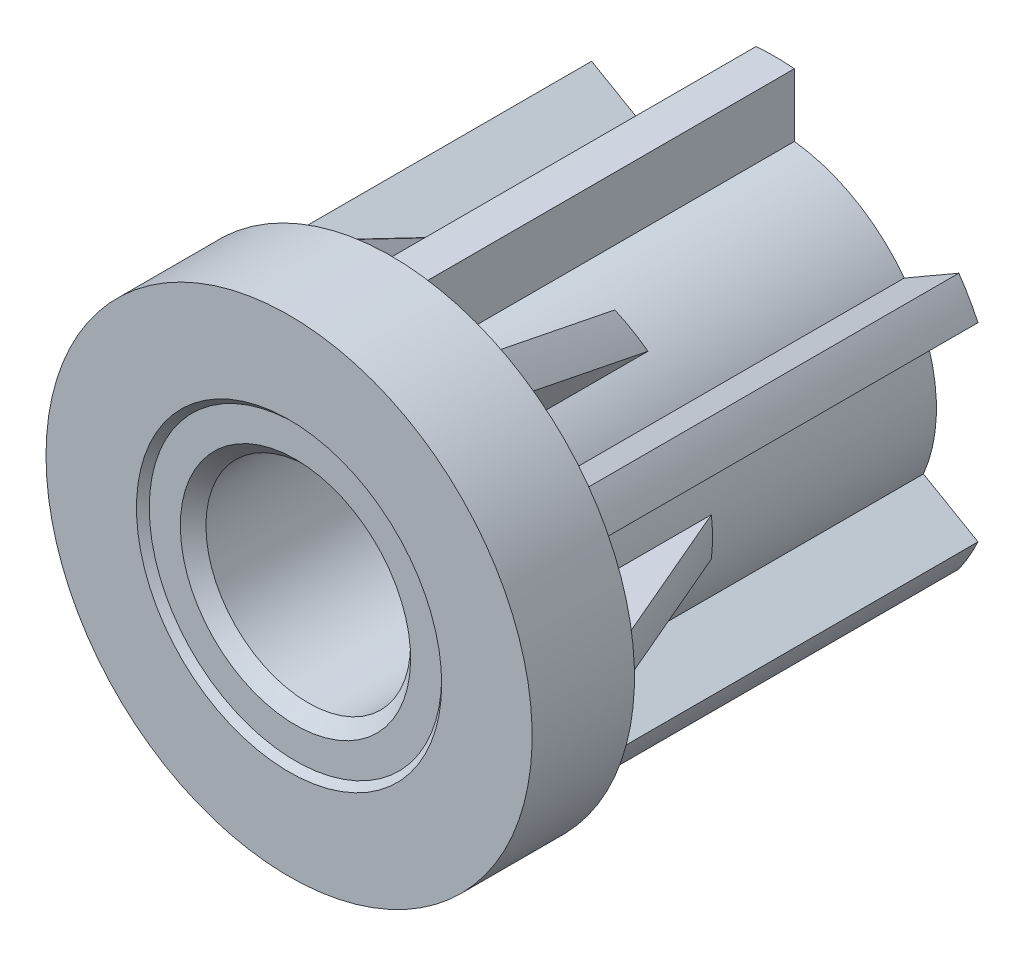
ISO-10303-21;
HEADER;
FILE_DESCRIPTION(('STEP AP214'),'2;1');
FILE_NAME('part.step','',(''),(''),'','','');
FILE_SCHEMA(('AUTOMOTIVE_DESIGN { 1 0 10303 214 1 1 1 1 }'));
ENDSEC;
DATA;
#1=APPLICATION_CONTEXT('core data for automotive mechanical design processes');
#2=APPLICATION_PROTOCOL_DEFINITION('international standard','automotive_design',2000,#1);
#3=PRODUCT_CONTEXT('',#1,'mechanical');
#4=PRODUCT('Part','Part','',(#3));
#5=PRODUCT_RELATED_PRODUCT_CATEGORY('part','',(#4));
#6=PRODUCT_DEFINITION_FORMATION('','',#4);
#7=PRODUCT_DEFINITION_CONTEXT('part definition',#1,'design');
#8=PRODUCT_DEFINITION('design','',#6,#7);
#9=PRODUCT_DEFINITION_SHAPE('','',#8);
#10=(LENGTH_UNIT() NAMED_UNIT(*) SI_UNIT(.MILLI.,.METRE.));
#11=(NAMED_UNIT(*) PLANE_ANGLE_UNIT() SI_UNIT($,.RADIAN.));
#12=(NAMED_UNIT(*) SI_UNIT($,.STERADIAN.) SOLID_ANGLE_UNIT());
#13=UNCERTAINTY_MEASURE_WITH_UNIT(LENGTH_MEASURE(1.E-05),#10,'distance_accuracy_value','');
#14=(GEOMETRIC_REPRESENTATION_CONTEXT(3) GLOBAL_UNCERTAINTY_ASSIGNED_CONTEXT((#13)) GLOBAL_UNIT_ASSIGNED_CONTEXT((#10,
#11,#12)) REPRESENTATION_CONTEXT('',''));
#15=CARTESIAN_POINT('',(0.,0.,0.));
#16=DIRECTION('',(0.,0.,1.));
#17=DIRECTION('',(1.,0.,0.));
#18=AXIS2_PLACEMENT_3D('',#15,#16,#17);
#19=CARTESIAN_POINT('',(0.,0.,-11.));
#20=DIRECTION('',(0.,0.,-1.));
#21=DIRECTION('',(-1.,0.,0.));
#22=AXIS2_PLACEMENT_3D('',#19,#20,#21);
#23=CYLINDRICAL_SURFACE('',#22,9.25);
#24=CARTESIAN_POINT('',(0.,0.,-15.));
#25=DIRECTION('',(0.,0.,-1.));
#26=DIRECTION('',(-1.,0.,0.));
#27=AXIS2_PLACEMENT_3D('',#24,#25,#26);
#28=CIRCLE('',#27,9.25);
#29=CARTESIAN_POINT('',(-9.25,0.,-15.));
#30=VERTEX_POINT('',#29);
#31=EDGE_CURVE('E1406',#30,#30,#28,.T.);
#32=ORIENTED_EDGE('',*,*,#31,.T.);
#33=EDGE_LOOP('',(#32));
#34=FACE_BOUND('',#33,.T.);
#35=CARTESIAN_POINT('',(0.,0.,-7.));
#36=DIRECTION('',(0.,0.,-1.));
#37=DIRECTION('',(-1.,0.,0.));
#38=AXIS2_PLACEMENT_3D('',#35,#36,#37);
#39=CIRCLE('',#38,9.25);
#40=CARTESIAN_POINT('',(-9.25,0.,-7.));
#41=VERTEX_POINT('',#40);
#42=EDGE_CURVE('E1403',#41,#41,#39,.F.);
#43=ORIENTED_EDGE('',*,*,#42,.T.);
#44=EDGE_LOOP('',(#43));
#45=FACE_BOUND('',#44,.T.);
#46=ADVANCED_FACE('F14',(#34,#45),#23,.F.);
#47=CARTESIAN_POINT('',(0.,8.625,-7.));
#48=DIRECTION('',(0.,0.,1.));
#49=DIRECTION('',(1.,0.,0.));
#50=AXIS2_PLACEMENT_3D('',#47,#48,#49);
#51=PLANE('',#50);
#52=ORIENTED_EDGE('',*,*,#42,.F.);
#53=EDGE_LOOP('',(#52));
#54=FACE_BOUND('',#53,.T.);
#55=CARTESIAN_POINT('',(0.,0.,-7.));
#56=DIRECTION('',(0.,0.,-1.));
#57=DIRECTION('',(0.,1.,0.));
#58=AXIS2_PLACEMENT_3D('',#55,#56,#57);
#59=CIRCLE('',#58,8.);
#60=CARTESIAN_POINT('',(0.,8.,-7.));
#61=VERTEX_POINT('',#60);
#62=EDGE_CURVE('E1407',#61,#61,#59,.F.);
#63=ORIENTED_EDGE('',*,*,#62,.T.);
#64=EDGE_LOOP('',(#63));
#65=FACE_BOUND('',#64,.T.);
#66=ADVANCED_FACE('F1426',(#54,#65),#51,.F.);
#67=CARTESIAN_POINT('',(0.,9.875,-15.));
#68=DIRECTION('',(0.,0.,1.));
#69=DIRECTION('',(1.,0.,0.));
#70=AXIS2_PLACEMENT_3D('',#67,#68,#69);
#71=PLANE('',#70);
#72=CARTESIAN_POINT('',(0.,0.,-15.));
#73=DIRECTION('',(0.,0.,-1.));
#74=DIRECTION('',(-1.,0.,0.));
#75=AXIS2_PLACEMENT_3D('',#72,#73,#74);
#76=CIRCLE('',#75,10.5);
#77=CARTESIAN_POINT('',(-10.5,0.,-15.));
#78=VERTEX_POINT('',#77);
#79=EDGE_CURVE('E1409',#78,#78,#76,.T.);
#80=ORIENTED_EDGE('',*,*,#79,.T.);
#81=EDGE_LOOP('',(#80));
#82=FACE_BOUND('',#81,.T.);
#83=ORIENTED_EDGE('',*,*,#31,.F.);
#84=EDGE_LOOP('',(#83));
#85=FACE_BOUND('',#84,.T.);
#86=ADVANCED_FACE('F1419',(#82,#85),#71,.F.);
#87=CARTESIAN_POINT('',(0.,0.,-22.5));
#88=DIRECTION('',(0.,0.,-1.));
#89=DIRECTION('',(-1.,0.,0.));
#90=AXIS2_PLACEMENT_3D('',#87,#88,#89);
#91=CYLINDRICAL_SURFACE('',#90,10.5);
#92=ORIENTED_EDGE('',*,*,#79,.F.);
#93=EDGE_LOOP('',(#92));
#94=FACE_BOUND('',#93,.T.);
#95=CARTESIAN_POINT('',(0.,0.,-30.));
#96=DIRECTION('',(0.,0.,-1.));
#97=DIRECTION('',(-1.,0.,0.));
#98=AXIS2_PLACEMENT_3D('',#95,#96,#97);
#99=CIRCLE('',#98,10.5);
#100=CARTESIAN_POINT('',(-10.5,0.,-30.));
#101=VERTEX_POINT('',#100);
#102=EDGE_CURVE('E694',#101,#101,#99,.F.);
#103=ORIENTED_EDGE('',*,*,#102,.F.);
#104=EDGE_LOOP('',(#103));
#105=FACE_BOUND('',#104,.T.);
#106=ADVANCED_FACE('F1417',(#94,#105),#91,.F.);
#107=CARTESIAN_POINT('',(0.,0.,-0.999999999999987));
#108=DIRECTION('',(0.,0.,1.));
#109=DIRECTION('',(1.,0.,0.));
#110=AXIS2_PLACEMENT_3D('',#107,#108,#109);
#111=CONICAL_SURFACE('',#110,17.5,0.402790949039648);
#112=CARTESIAN_POINT('',(-17.4355957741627,-1.5,-1.));
#113=CARTESIAN_POINT('',(-17.0256602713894,-1.5,-1.95854648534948));
#114=CARTESIAN_POINT('',(-16.6156395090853,-1.5,-2.91705652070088));
#115=CARTESIAN_POINT('',(-15.7953731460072,-1.5,-4.83398027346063));
#116=CARTESIAN_POINT('',(-15.385127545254,-1.5,-5.79239399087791));
#117=CARTESIAN_POINT('',(-14.5643570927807,-1.5,-7.709101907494));
#118=CARTESIAN_POINT('',(-14.153832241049,-1.5,-8.66739610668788));
#119=CARTESIAN_POINT('',(-13.3324133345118,-1.5,-10.5838263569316));
#120=CARTESIAN_POINT('',(-12.9215192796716,-1.5,-11.5419624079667));
#121=CARTESIAN_POINT('',(-12.5103956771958,-1.5,-12.5));
#122=B_SPLINE_CURVE_WITH_KNOTS('',3,(#112,#113,#114,#115,#116,#117,#118,#119,#120,#121),
.UNSPECIFIED.,.F.,.F.,(4,2,2,2,4),(0.,3.12757516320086,6.25515003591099,9.38272503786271,
12.5103003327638),.UNSPECIFIED.);
#123=CARTESIAN_POINT('',(-17.4355957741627,-1.5,-1.));
#124=VERTEX_POINT('',#123);
#125=CARTESIAN_POINT('',(-12.5103956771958,-1.5,-12.5));
#126=VERTEX_POINT('',#125);
#127=EDGE_CURVE('E683',#124,#126,#122,.T.);
#128=ORIENTED_EDGE('',*,*,#127,.F.);
#129=CARTESIAN_POINT('',(4.36868134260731E-13,0.,-1.));
#130=DIRECTION('',(0.,0.,1.));
#131=DIRECTION('',(1.,0.,0.));
#132=AXIS2_PLACEMENT_3D('',#129,#130,#131);
#133=CIRCLE('',#132,17.5000000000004);
#134=CARTESIAN_POINT('',(-17.4355957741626,1.5,-1.));
#135=VERTEX_POINT('',#134);
#136=EDGE_CURVE('E323',#135,#124,#133,.T.);
#137=ORIENTED_EDGE('',*,*,#136,.F.);
#138=CARTESIAN_POINT('',(-12.5103956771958,1.5,-12.5));
#139=CARTESIAN_POINT('',(-12.9215192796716,1.5,-11.5419624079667));
#140=CARTESIAN_POINT('',(-13.3324133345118,1.5,-10.5838263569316));
#141=CARTESIAN_POINT('',(-14.153832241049,1.5,-8.66739610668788));
#142=CARTESIAN_POINT('',(-14.5643570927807,1.5,-7.709101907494));
#143=CARTESIAN_POINT('',(-15.385127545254,1.5,-5.79239399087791));
#144=CARTESIAN_POINT('',(-15.7953731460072,1.5,-4.83398027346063));
#145=CARTESIAN_POINT('',(-16.6156395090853,1.5,-2.91705652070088));
#146=CARTESIAN_POINT('',(-17.0256602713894,1.5,-1.95854648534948));
#147=CARTESIAN_POINT('',(-17.4355957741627,1.5,-1.));
#148=B_SPLINE_CURVE_WITH_KNOTS('',3,(#138,#139,#140,#141,#142,#143,#144,#145,#146,#147),
.UNSPECIFIED.,.F.,.F.,(4,2,2,2,4),(0.,3.12757529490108,6.2551502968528,9.38272516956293,
12.5103003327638),.UNSPECIFIED.);
#149=CARTESIAN_POINT('',(-12.5103956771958,1.5,-12.5));
#150=VERTEX_POINT('',#149);
#151=EDGE_CURVE('E316',#150,#135,#148,.T.);
#152=ORIENTED_EDGE('',*,*,#151,.F.);
#153=CARTESIAN_POINT('',(0.,0.,-12.5));
#154=DIRECTION('',(0.,0.,-1.));
#155=DIRECTION('',(-1.,0.,0.));
#156=AXIS2_PLACEMENT_3D('',#153,#154,#155);
#157=CIRCLE('',#156,12.6);
#158=EDGE_CURVE('E320',#126,#150,#157,.T.);
#159=ORIENTED_EDGE('',*,*,#158,.F.);
#160=EDGE_LOOP('',(#128,#137,#152,#159));
#161=FACE_BOUND('',#160,.T.);
#162=ADVANCED_FACE('F318',(#161),#111,.T.);
#163=CARTESIAN_POINT('',(0.,0.,-1.));
#164=DIRECTION('',(0.,0.,1.));
#165=DIRECTION('',(1.,0.,0.));
#166=AXIS2_PLACEMENT_3D('',#163,#164,#165);
#167=CONICAL_SURFACE('',#166,17.5,0.402790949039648);
#168=CARTESIAN_POINT('',(-7.41875978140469,-15.8496688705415,-1.));
#169=CARTESIAN_POINT('',(-7.21379203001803,-15.4946543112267,-1.95854648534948));
#170=CARTESIAN_POINT('',(-7.008781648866,-15.1395659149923,-2.91705652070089));
#171=CARTESIAN_POINT('',(-6.59864846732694,-14.4291944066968,-4.83398027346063));
#172=CARTESIAN_POINT('',(-6.39352566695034,-14.0739112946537,-5.79239399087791));
#173=CARTESIAN_POINT('',(-5.98314044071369,-13.3631032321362,-7.70910190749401));
#174=CARTESIAN_POINT('',(-5.77787801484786,-13.0075782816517,-8.66739610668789));
#175=CARTESIAN_POINT('',(-5.36716856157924,-12.2962086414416,-10.5838263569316));
#176=CARTESIAN_POINT('',(-5.16172153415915,-11.940363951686,-11.5419624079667));
#177=CARTESIAN_POINT('',(-4.95615973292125,-11.5843204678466,-12.5));
#178=B_SPLINE_CURVE_WITH_KNOTS('',3,(#168,#169,#170,#171,#172,#173,#174,#175,#176,#177),
.UNSPECIFIED.,.F.,.F.,(4,2,2,2,4),(0.,3.12757516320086,6.25515003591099,9.38272503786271,
12.5103003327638),.UNSPECIFIED.);
#179=CARTESIAN_POINT('',(-7.41875978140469,-15.8496688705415,-1.));
#180=VERTEX_POINT('',#179);
#181=CARTESIAN_POINT('',(-4.95615973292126,-11.5843204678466,-12.5));
#182=VERTEX_POINT('',#181);
#183=EDGE_CURVE('E634',#180,#182,#178,.T.);
#184=ORIENTED_EDGE('',*,*,#183,.F.);
#185=CARTESIAN_POINT('',(2.40580703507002E-13,6.7309468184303E-13,-1.));
#186=DIRECTION('',(0.,0.,1.));
#187=DIRECTION('',(1.,0.,0.));
#188=AXIS2_PLACEMENT_3D('',#185,#186,#187);
#189=CIRCLE('',#188,17.5000000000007);
#190=CARTESIAN_POINT('',(-10.016835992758,-14.3496688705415,-1.));
#191=VERTEX_POINT('',#190);
#192=EDGE_CURVE('E650',#191,#180,#189,.T.);
#193=ORIENTED_EDGE('',*,*,#192,.F.);
#194=CARTESIAN_POINT('',(-7.55423594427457,-10.0843204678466,-12.5));
#195=CARTESIAN_POINT('',(-7.75979774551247,-10.440363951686,-11.5419624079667));
#196=CARTESIAN_POINT('',(-7.96524477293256,-10.7962086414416,-10.5838263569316));
#197=CARTESIAN_POINT('',(-8.37595422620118,-11.5075782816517,-8.66739610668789));
#198=CARTESIAN_POINT('',(-8.581216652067,-11.8631032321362,-7.70910190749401));
#199=CARTESIAN_POINT('',(-8.99160187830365,-12.5739112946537,-5.79239399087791));
#200=CARTESIAN_POINT('',(-9.19672467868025,-12.9291944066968,-4.83398027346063));
#201=CARTESIAN_POINT('',(-9.60685786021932,-13.6395659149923,-2.91705652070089));
#202=CARTESIAN_POINT('',(-9.81186824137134,-13.9946543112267,-1.95854648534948));
#203=CARTESIAN_POINT('',(-10.016835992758,-14.3496688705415,-1.));
#204=B_SPLINE_CURVE_WITH_KNOTS('',3,(#194,#195,#196,#197,#198,#199,#200,#201,#202,#203),
.UNSPECIFIED.,.F.,.F.,(4,2,2,2,4),(0.,3.12757529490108,6.25515029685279,9.38272516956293,
12.5103003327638),.UNSPECIFIED.);
#205=CARTESIAN_POINT('',(-7.55423594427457,-10.0843204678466,-12.5));
#206=VERTEX_POINT('',#205);
#207=EDGE_CURVE('E642',#206,#191,#204,.T.);
#208=ORIENTED_EDGE('',*,*,#207,.F.);
#209=CARTESIAN_POINT('',(0.,0.,-12.5));
#210=DIRECTION('',(0.,0.,-1.));
#211=DIRECTION('',(-1.,0.,0.));
#212=AXIS2_PLACEMENT_3D('',#209,#210,#211);
#213=CIRCLE('',#212,12.6);
#214=EDGE_CURVE('E855',#182,#206,#213,.T.);
#215=ORIENTED_EDGE('',*,*,#214,.F.);
#216=EDGE_LOOP('',(#184,#193,#208,#215));
#217=FACE_BOUND('',#216,.T.);
#218=ADVANCED_FACE('F623',(#217),#167,.T.);
#219=CARTESIAN_POINT('',(0.,0.,-0.999999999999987));
#220=DIRECTION('',(0.,0.,1.));
#221=DIRECTION('',(1.,0.,0.));
#222=AXIS2_PLACEMENT_3D('',#219,#220,#221);
#223=CONICAL_SURFACE('',#222,17.5,0.402790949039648);
#224=CARTESIAN_POINT('',(10.016835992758,-14.3496688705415,-1.));
#225=CARTESIAN_POINT('',(9.81186824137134,-13.9946543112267,-1.95854648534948));
#226=CARTESIAN_POINT('',(9.60685786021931,-13.6395659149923,-2.91705652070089));
#227=CARTESIAN_POINT('',(9.19672467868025,-12.9291944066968,-4.83398027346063));
#228=CARTESIAN_POINT('',(8.99160187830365,-12.5739112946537,-5.79239399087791));
#229=CARTESIAN_POINT('',(8.581216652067,-11.8631032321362,-7.709101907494));
#230=CARTESIAN_POINT('',(8.37595422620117,-11.5075782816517,-8.66739610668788));
#231=CARTESIAN_POINT('',(7.96524477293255,-10.7962086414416,-10.5838263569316));
#232=CARTESIAN_POINT('',(7.75979774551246,-10.440363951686,-11.5419624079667));
#233=CARTESIAN_POINT('',(7.55423594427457,-10.0843204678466,-12.5));
#234=B_SPLINE_CURVE_WITH_KNOTS('',3,(#224,#225,#226,#227,#228,#229,#230,#231,#232,#233),
.UNSPECIFIED.,.F.,.F.,(4,2,2,2,4),(0.,3.12757516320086,6.25515003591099,9.38272503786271,
12.5103003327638),.UNSPECIFIED.);
#235=CARTESIAN_POINT('',(10.016835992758,-14.3496688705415,-1.));
#236=VERTEX_POINT('',#235);
#237=CARTESIAN_POINT('',(7.55423594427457,-10.0843204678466,-12.5));
#238=VERTEX_POINT('',#237);
#239=EDGE_CURVE('E604',#236,#238,#234,.T.);
#240=ORIENTED_EDGE('',*,*,#239,.F.);
#241=CARTESIAN_POINT('',(-3.51834302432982E-13,8.70270291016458E-13,-1.));
#242=DIRECTION('',(0.,0.,1.));
#243=DIRECTION('',(1.,0.,0.));
#244=AXIS2_PLACEMENT_3D('',#241,#242,#243);
#245=CIRCLE('',#244,17.5000000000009);
#246=CARTESIAN_POINT('',(7.41875978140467,-15.8496688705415,-1.));
#247=VERTEX_POINT('',#246);
#248=EDGE_CURVE('E835',#247,#236,#245,.T.);
#249=ORIENTED_EDGE('',*,*,#248,.F.);
#250=CARTESIAN_POINT('',(4.95615973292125,-11.5843204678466,-12.5));
#251=CARTESIAN_POINT('',(5.16172153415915,-11.940363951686,-11.5419624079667));
#252=CARTESIAN_POINT('',(5.36716856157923,-12.2962086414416,-10.5838263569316));
#253=CARTESIAN_POINT('',(5.77787801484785,-13.0075782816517,-8.66739610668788));
#254=CARTESIAN_POINT('',(5.98314044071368,-13.3631032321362,-7.709101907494));
#255=CARTESIAN_POINT('',(6.39352566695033,-14.0739112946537,-5.7923939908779));
#256=CARTESIAN_POINT('',(6.59864846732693,-14.4291944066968,-4.83398027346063));
#257=CARTESIAN_POINT('',(7.008781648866,-15.1395659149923,-2.91705652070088));
#258=CARTESIAN_POINT('',(7.21379203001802,-15.4946543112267,-1.95854648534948));
#259=CARTESIAN_POINT('',(7.41875978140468,-15.8496688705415,-1.));
#260=B_SPLINE_CURVE_WITH_KNOTS('',3,(#250,#251,#252,#253,#254,#255,#256,#257,#258,#259),
.UNSPECIFIED.,.F.,.F.,(4,2,2,2,4),(0.,3.12757529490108,6.25515029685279,9.38272516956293,
12.5103003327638),.UNSPECIFIED.);
#261=CARTESIAN_POINT('',(4.95615973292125,-11.5843204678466,-12.5));
#262=VERTEX_POINT('',#261);
#263=EDGE_CURVE('E613',#262,#247,#260,.T.);
#264=ORIENTED_EDGE('',*,*,#263,.F.);
#265=CARTESIAN_POINT('',(0.,0.,-12.5));
#266=DIRECTION('',(0.,0.,-1.));
#267=DIRECTION('',(-1.,0.,0.));
#268=AXIS2_PLACEMENT_3D('',#265,#266,#267);
#269=CIRCLE('',#268,12.6);
#270=EDGE_CURVE('E829',#238,#262,#269,.T.);
#271=ORIENTED_EDGE('',*,*,#270,.F.);
#272=EDGE_LOOP('',(#240,#249,#264,#271));
#273=FACE_BOUND('',#272,.T.);
#274=ADVANCED_FACE('F619',(#273),#223,.T.);
#275=CARTESIAN_POINT('',(0.,0.,-0.999999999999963));
#276=DIRECTION('',(0.,0.,1.));
#277=DIRECTION('',(1.,0.,0.));
#278=AXIS2_PLACEMENT_3D('',#275,#276,#277);
#279=CONICAL_SURFACE('',#278,17.5,0.402790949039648);
#280=CARTESIAN_POINT('',(12.5103956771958,-1.5,-12.5));
#281=CARTESIAN_POINT('',(12.9215192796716,-1.5,-11.5419624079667));
#282=CARTESIAN_POINT('',(13.3324133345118,-1.5,-10.5838263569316));
#283=CARTESIAN_POINT('',(14.153832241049,-1.5,-8.66739610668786));
#284=CARTESIAN_POINT('',(14.5643570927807,-1.5,-7.70910190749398));
#285=CARTESIAN_POINT('',(15.385127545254,-1.5,-5.79239399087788));
#286=CARTESIAN_POINT('',(15.7953731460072,-1.5,-4.8339802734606));
#287=CARTESIAN_POINT('',(16.6156395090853,-1.5,-2.91705652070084));
#288=CARTESIAN_POINT('',(17.0256602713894,-1.5,-1.95854648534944));
#289=CARTESIAN_POINT('',(17.4355957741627,-1.5,-0.999999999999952));
#290=B_SPLINE_CURVE_WITH_KNOTS('',3,(#280,#281,#282,#283,#284,#285,#286,#287,#288,#289),
.UNSPECIFIED.,.F.,.F.,(4,2,2,2,4),(0.,3.12757529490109,6.25515029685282,9.38272516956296,
12.5103003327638),.UNSPECIFIED.);
#291=CARTESIAN_POINT('',(12.5103956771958,-1.5,-12.5));
#292=VERTEX_POINT('',#291);
#293=CARTESIAN_POINT('',(17.4355957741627,-1.5,-0.999999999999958));
#294=VERTEX_POINT('',#293);
#295=EDGE_CURVE('E564',#292,#294,#290,.T.);
#296=ORIENTED_EDGE('',*,*,#295,.F.);
#297=CARTESIAN_POINT('',(0.,0.,-12.5));
#298=DIRECTION('',(0.,0.,-1.));
#299=DIRECTION('',(-1.,0.,0.));
#300=AXIS2_PLACEMENT_3D('',#297,#298,#299);
#301=CIRCLE('',#300,12.6);
#302=CARTESIAN_POINT('',(12.5103956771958,1.5,-12.5));
#303=VERTEX_POINT('',#302);
#304=EDGE_CURVE('E805',#303,#292,#301,.T.);
#305=ORIENTED_EDGE('',*,*,#304,.F.);
#306=CARTESIAN_POINT('',(17.4355957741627,1.5,-0.999999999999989));
#307=CARTESIAN_POINT('',(17.0256602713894,1.5,-1.95854648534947));
#308=CARTESIAN_POINT('',(16.6156395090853,1.5,-2.91705652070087));
#309=CARTESIAN_POINT('',(15.7953731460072,1.5,-4.83398027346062));
#310=CARTESIAN_POINT('',(15.385127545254,1.5,-5.7923939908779));
#311=CARTESIAN_POINT('',(14.5643570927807,1.5,-7.709101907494));
#312=CARTESIAN_POINT('',(14.153832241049,1.5,-8.66739610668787));
#313=CARTESIAN_POINT('',(13.3324133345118,1.5,-10.5838263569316));
#314=CARTESIAN_POINT('',(12.9215192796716,1.5,-11.5419624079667));
#315=CARTESIAN_POINT('',(12.5103956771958,1.5,-12.5));
#316=B_SPLINE_CURVE_WITH_KNOTS('',3,(#306,#307,#308,#309,#310,#311,#312,#313,#314,#315),
.UNSPECIFIED.,.F.,.F.,(4,2,2,2,4),(0.,3.12757516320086,6.255150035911,9.38272503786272,
12.5103003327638),.UNSPECIFIED.);
#317=CARTESIAN_POINT('',(17.4355957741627,1.5,-0.999999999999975));
#318=VERTEX_POINT('',#317);
#319=EDGE_CURVE('E555',#318,#303,#316,.T.);
#320=ORIENTED_EDGE('',*,*,#319,.F.);
#321=CARTESIAN_POINT('',(-4.47757571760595E-13,0.,-0.999999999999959));
#322=DIRECTION('',(0.,0.,1.));
#323=DIRECTION('',(1.,0.,0.));
#324=AXIS2_PLACEMENT_3D('',#321,#322,#323);
#325=CIRCLE('',#324,17.5000000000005);
#326=EDGE_CURVE('E571',#294,#318,#325,.T.);
#327=ORIENTED_EDGE('',*,*,#326,.F.);
#328=EDGE_LOOP('',(#296,#305,#320,#327));
#329=FACE_BOUND('',#328,.T.);
#330=ADVANCED_FACE('F498',(#329),#279,.T.);
#331=CARTESIAN_POINT('',(0.,0.,-0.999999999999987));
#332=DIRECTION('',(0.,0.,1.));
#333=DIRECTION('',(1.,0.,0.));
#334=AXIS2_PLACEMENT_3D('',#331,#332,#333);
#335=CONICAL_SURFACE('',#334,17.5,0.402790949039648);
#336=CARTESIAN_POINT('',(7.4187597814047,15.8496688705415,-1.));
#337=CARTESIAN_POINT('',(7.21379203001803,15.4946543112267,-1.95854648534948));
#338=CARTESIAN_POINT('',(7.00878164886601,15.1395659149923,-2.91705652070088));
#339=CARTESIAN_POINT('',(6.59864846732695,14.4291944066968,-4.83398027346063));
#340=CARTESIAN_POINT('',(6.39352566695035,14.0739112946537,-5.79239399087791));
#341=CARTESIAN_POINT('',(5.98314044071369,13.3631032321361,-7.709101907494));
#342=CARTESIAN_POINT('',(5.77787801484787,13.0075782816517,-8.66739610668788));
#343=CARTESIAN_POINT('',(5.36716856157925,12.2962086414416,-10.5838263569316));
#344=CARTESIAN_POINT('',(5.16172153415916,11.940363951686,-11.5419624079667));
#345=CARTESIAN_POINT('',(4.95615973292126,11.5843204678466,-12.5));
#346=B_SPLINE_CURVE_WITH_KNOTS('',3,(#336,#337,#338,#339,#340,#341,#342,#343,#344,#345),
.UNSPECIFIED.,.F.,.F.,(4,2,2,2,4),(0.,3.12757516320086,6.25515003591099,9.38272503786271,
12.5103003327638),.UNSPECIFIED.);
#347=CARTESIAN_POINT('',(7.4187597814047,15.8496688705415,-1.));
#348=VERTEX_POINT('',#347);
#349=CARTESIAN_POINT('',(4.95615973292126,11.5843204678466,-12.5));
#350=VERTEX_POINT('',#349);
#351=EDGE_CURVE('E504',#348,#350,#346,.T.);
#352=ORIENTED_EDGE('',*,*,#351,.F.);
#353=CARTESIAN_POINT('',(-5.17035488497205E-13,-7.16016366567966E-13,-1.));
#354=DIRECTION('',(0.,0.,1.));
#355=DIRECTION('',(1.,0.,0.));
#356=AXIS2_PLACEMENT_3D('',#353,#354,#355);
#357=CIRCLE('',#356,17.5000000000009);
#358=CARTESIAN_POINT('',(10.016835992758,14.3496688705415,-1.));
#359=VERTEX_POINT('',#358);
#360=EDGE_CURVE('E520',#359,#348,#357,.T.);
#361=ORIENTED_EDGE('',*,*,#360,.F.);
#362=CARTESIAN_POINT('',(7.55423594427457,10.0843204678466,-12.5));
#363=CARTESIAN_POINT('',(7.75979774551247,10.440363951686,-11.5419624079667));
#364=CARTESIAN_POINT('',(7.96524477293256,10.7962086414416,-10.5838263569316));
#365=CARTESIAN_POINT('',(8.37595422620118,11.5075782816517,-8.66739610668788));
#366=CARTESIAN_POINT('',(8.581216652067,11.8631032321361,-7.709101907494));
#367=CARTESIAN_POINT('',(8.99160187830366,12.5739112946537,-5.79239399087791));
#368=CARTESIAN_POINT('',(9.19672467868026,12.9291944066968,-4.83398027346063));
#369=CARTESIAN_POINT('',(9.60685786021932,13.6395659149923,-2.91705652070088));
#370=CARTESIAN_POINT('',(9.81186824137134,13.9946543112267,-1.95854648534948));
#371=CARTESIAN_POINT('',(10.016835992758,14.3496688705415,-1.));
#372=B_SPLINE_CURVE_WITH_KNOTS('',3,(#362,#363,#364,#365,#366,#367,#368,#369,#370,#371),
.UNSPECIFIED.,.F.,.F.,(4,2,2,2,4),(0.,3.12757529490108,6.25515029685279,9.38272516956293,
12.5103003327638),.UNSPECIFIED.);
#373=CARTESIAN_POINT('',(7.55423594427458,10.0843204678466,-12.5));
#374=VERTEX_POINT('',#373);
#375=EDGE_CURVE('E512',#374,#359,#372,.T.);
#376=ORIENTED_EDGE('',*,*,#375,.F.);
#377=CARTESIAN_POINT('',(0.,0.,-12.5));
#378=DIRECTION('',(0.,0.,-1.));
#379=DIRECTION('',(-1.,0.,0.));
#380=AXIS2_PLACEMENT_3D('',#377,#378,#379);
#381=CIRCLE('',#380,12.6);
#382=EDGE_CURVE('E780',#350,#374,#381,.T.);
#383=ORIENTED_EDGE('',*,*,#382,.F.);
#384=EDGE_LOOP('',(#352,#361,#376,#383));
#385=FACE_BOUND('',#384,.T.);
#386=ADVANCED_FACE('F491',(#385),#335,.T.);
#387=CARTESIAN_POINT('',(0.,0.,-1.));
#388=DIRECTION('',(0.,0.,1.));
#389=DIRECTION('',(1.,0.,0.));
#390=AXIS2_PLACEMENT_3D('',#387,#388,#389);
#391=CONICAL_SURFACE('',#390,17.5,0.402790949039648);
#392=CARTESIAN_POINT('',(-10.016835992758,14.3496688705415,-1.));
#393=CARTESIAN_POINT('',(-9.81186824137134,13.9946543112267,-1.95854648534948));
#394=CARTESIAN_POINT('',(-9.60685786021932,13.6395659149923,-2.91705652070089));
#395=CARTESIAN_POINT('',(-9.19672467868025,12.9291944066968,-4.83398027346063));
#396=CARTESIAN_POINT('',(-8.99160187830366,12.5739112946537,-5.79239399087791));
#397=CARTESIAN_POINT('',(-8.581216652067,11.8631032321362,-7.70910190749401));
#398=CARTESIAN_POINT('',(-8.37595422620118,11.5075782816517,-8.66739610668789));
#399=CARTESIAN_POINT('',(-7.96524477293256,10.7962086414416,-10.5838263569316));
#400=CARTESIAN_POINT('',(-7.75979774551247,10.440363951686,-11.5419624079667));
#401=CARTESIAN_POINT('',(-7.55423594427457,10.0843204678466,-12.5));
#402=B_SPLINE_CURVE_WITH_KNOTS('',3,(#392,#393,#394,#395,#396,#397,#398,#399,#400,#401),
.UNSPECIFIED.,.F.,.F.,(4,2,2,2,4),(0.,3.12757516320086,6.25515003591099,9.38272503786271,
12.5103003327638),.UNSPECIFIED.);
#403=CARTESIAN_POINT('',(-10.016835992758,14.3496688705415,-1.));
#404=VERTEX_POINT('',#403);
#405=CARTESIAN_POINT('',(-7.55423594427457,10.0843204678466,-12.5));
#406=VERTEX_POINT('',#405);
#407=EDGE_CURVE('E464',#404,#406,#402,.T.);
#408=ORIENTED_EDGE('',*,*,#407,.F.);
#409=CARTESIAN_POINT('',(4.06670067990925E-13,-4.44233770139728E-13,-1.));
#410=DIRECTION('',(0.,0.,1.));
#411=DIRECTION('',(1.,0.,0.));
#412=AXIS2_PLACEMENT_3D('',#409,#410,#411);
#413=CIRCLE('',#412,17.5000000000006);
#414=CARTESIAN_POINT('',(-7.4187597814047,15.8496688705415,-1.));
#415=VERTEX_POINT('',#414);
#416=EDGE_CURVE('E888',#415,#404,#413,.T.);
#417=ORIENTED_EDGE('',*,*,#416,.F.);
#418=CARTESIAN_POINT('',(-4.95615973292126,11.5843204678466,-12.5));
#419=CARTESIAN_POINT('',(-5.16172153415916,11.940363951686,-11.5419624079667));
#420=CARTESIAN_POINT('',(-5.36716856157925,12.2962086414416,-10.5838263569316));
#421=CARTESIAN_POINT('',(-5.77787801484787,13.0075782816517,-8.66739610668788));
#422=CARTESIAN_POINT('',(-5.98314044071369,13.3631032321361,-7.70910190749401));
#423=CARTESIAN_POINT('',(-6.39352566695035,14.0739112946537,-5.79239399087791));
#424=CARTESIAN_POINT('',(-6.59864846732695,14.4291944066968,-4.83398027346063));
#425=CARTESIAN_POINT('',(-7.00878164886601,15.1395659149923,-2.91705652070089));
#426=CARTESIAN_POINT('',(-7.21379203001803,15.4946543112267,-1.95854648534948));
#427=CARTESIAN_POINT('',(-7.41875978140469,15.8496688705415,-1.));
#428=B_SPLINE_CURVE_WITH_KNOTS('',3,(#418,#419,#420,#421,#422,#423,#424,#425,#426,#427),
.UNSPECIFIED.,.F.,.F.,(4,2,2,2,4),(0.,3.12757529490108,6.2551502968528,9.38272516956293,
12.5103003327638),.UNSPECIFIED.);
#429=CARTESIAN_POINT('',(-4.95615973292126,11.5843204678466,-12.5));
#430=VERTEX_POINT('',#429);
#431=EDGE_CURVE('E474',#430,#415,#428,.T.);
#432=ORIENTED_EDGE('',*,*,#431,.F.);
#433=CARTESIAN_POINT('',(0.,0.,-12.5));
#434=DIRECTION('',(0.,0.,-1.));
#435=DIRECTION('',(-1.,0.,0.));
#436=AXIS2_PLACEMENT_3D('',#433,#434,#435);
#437=CIRCLE('',#436,12.6);
#438=EDGE_CURVE('E760',#406,#430,#437,.T.);
#439=ORIENTED_EDGE('',*,*,#438,.F.);
#440=EDGE_LOOP('',(#408,#417,#432,#439));
#441=FACE_BOUND('',#440,.T.);
#442=ADVANCED_FACE('F485',(#441),#391,.T.);
#443=CARTESIAN_POINT('',(0.,6.3,-30.));
#444=DIRECTION('',(0.,0.,-1.));
#445=DIRECTION('',(-1.,0.,0.));
#446=AXIS2_PLACEMENT_3D('',#443,#444,#445);
#447=PLANE('',#446);
#448=ORIENTED_EDGE('',*,*,#102,.T.);
#449=EDGE_LOOP('',(#448));
#450=FACE_BOUND('',#449,.T.);
#451=CARTESIAN_POINT('',(1.27980959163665E-13,0.,-30.));
#452=DIRECTION('',(0.,0.,1.));
#453=DIRECTION('',(1.,0.,0.));
#454=AXIS2_PLACEMENT_3D('',#451,#452,#453);
#455=CIRCLE('',#454,17.5);
#456=CARTESIAN_POINT('',(-14.3496688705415,10.016835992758,-30.));
#457=VERTEX_POINT('',#456);
#458=CARTESIAN_POINT('',(-15.8496688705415,7.41875978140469,-30.));
#459=VERTEX_POINT('',#458);
#460=EDGE_CURVE('E456',#457,#459,#455,.T.);
#461=ORIENTED_EDGE('',*,*,#460,.F.);
#462=DIRECTION('',(0.866025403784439,-0.5,0.));
#463=VECTOR('',#462,1.);
#464=CARTESIAN_POINT('',(-6.9352130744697,5.73609794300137,-30.));
#465=LINE('',#464,#463);
#466=CARTESIAN_POINT('',(-10.0843204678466,7.55423594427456,-30.));
#467=VERTEX_POINT('',#466);
#468=EDGE_CURVE('E882',#467,#457,#465,.F.);
#469=ORIENTED_EDGE('',*,*,#468,.F.);
#470=CARTESIAN_POINT('',(0.,0.,-30.));
#471=DIRECTION('',(0.,0.,-1.));
#472=DIRECTION('',(-1.,0.,0.));
#473=AXIS2_PLACEMENT_3D('',#470,#471,#472);
#474=CIRCLE('',#473,12.6);
#475=CARTESIAN_POINT('',(-1.5,12.5103956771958,-30.));
#476=VERTEX_POINT('',#475);
#477=EDGE_CURVE('E460',#476,#467,#474,.F.);
#478=ORIENTED_EDGE('',*,*,#477,.F.);
#479=DIRECTION('',(0.,1.,0.));
#480=VECTOR('',#479,1.);
#481=CARTESIAN_POINT('',(-1.5,17.4355957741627,-30.));
#482=LINE('',#481,#480);
#483=CARTESIAN_POINT('',(-1.5,17.4355957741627,-30.));
#484=VERTEX_POINT('',#483);
#485=EDGE_CURVE('E767',#484,#476,#482,.F.);
#486=ORIENTED_EDGE('',*,*,#485,.F.);
#487=CARTESIAN_POINT('',(0.,-9.42253219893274E-13,-30.));
#488=DIRECTION('',(0.,0.,1.));
#489=DIRECTION('',(1.,0.,0.));
#490=AXIS2_PLACEMENT_3D('',#487,#488,#489);
#491=CIRCLE('',#490,17.5000000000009);
#492=CARTESIAN_POINT('',(1.5,17.4355957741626,-30.));
#493=VERTEX_POINT('',#492);
#494=EDGE_CURVE('E768',#493,#484,#491,.T.);
#495=ORIENTED_EDGE('',*,*,#494,.F.);
#496=DIRECTION('',(0.,-1.,0.));
#497=VECTOR('',#496,1.);
#498=CARTESIAN_POINT('',(1.5,8.87411967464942,-30.));
#499=LINE('',#498,#497);
#500=CARTESIAN_POINT('',(1.5,12.5103956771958,-30.));
#501=VERTEX_POINT('',#500);
#502=EDGE_CURVE('E772',#501,#493,#499,.F.);
#503=ORIENTED_EDGE('',*,*,#502,.F.);
#504=CARTESIAN_POINT('',(0.,0.,-30.));
#505=DIRECTION('',(0.,0.,-1.));
#506=DIRECTION('',(-1.,0.,0.));
#507=AXIS2_PLACEMENT_3D('',#504,#505,#506);
#508=CIRCLE('',#507,12.6);
#509=CARTESIAN_POINT('',(10.0843204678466,7.55423594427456,-30.));
#510=VERTEX_POINT('',#509);
#511=EDGE_CURVE('E776',#510,#501,#508,.F.);
#512=ORIENTED_EDGE('',*,*,#511,.F.);
#513=DIRECTION('',(0.866025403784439,0.5,0.));
#514=VECTOR('',#513,1.);
#515=CARTESIAN_POINT('',(14.3496688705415,10.016835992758,-30.));
#516=LINE('',#515,#514);
#517=CARTESIAN_POINT('',(14.3496688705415,10.016835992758,-30.));
#518=VERTEX_POINT('',#517);
#519=EDGE_CURVE('E521',#518,#510,#516,.F.);
#520=ORIENTED_EDGE('',*,*,#519,.F.);
#521=CARTESIAN_POINT('',(-6.62497834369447E-13,-2.7434304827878E-13,-30.));
#522=DIRECTION('',(0.,0.,1.));
#523=DIRECTION('',(1.,0.,0.));
#524=AXIS2_PLACEMENT_3D('',#521,#522,#523);
#525=CIRCLE('',#524,17.5000000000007);
#526=CARTESIAN_POINT('',(15.8496688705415,7.41875978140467,-30.));
#527=VERTEX_POINT('',#526);
#528=EDGE_CURVE('E522',#527,#518,#525,.T.);
#529=ORIENTED_EDGE('',*,*,#528,.F.);
#530=DIRECTION('',(-0.866025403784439,-0.5,0.));
#531=VECTOR('',#530,1.);
#532=CARTESIAN_POINT('',(8.4352130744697,3.13802173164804,-30.));
#533=LINE('',#532,#531);
#534=CARTESIAN_POINT('',(11.5843204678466,4.95615973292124,-30.));
#535=VERTEX_POINT('',#534);
#536=EDGE_CURVE('E798',#535,#527,#533,.F.);
#537=ORIENTED_EDGE('',*,*,#536,.F.);
#538=CARTESIAN_POINT('',(0.,0.,-30.));
#539=DIRECTION('',(0.,0.,-1.));
#540=DIRECTION('',(-1.,0.,0.));
#541=AXIS2_PLACEMENT_3D('',#538,#539,#540);
#542=CIRCLE('',#541,12.6);
#543=CARTESIAN_POINT('',(11.5843204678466,-4.95615973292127,-30.));
#544=VERTEX_POINT('',#543);
#545=EDGE_CURVE('E563',#544,#535,#542,.F.);
#546=ORIENTED_EDGE('',*,*,#545,.F.);
#547=DIRECTION('',(0.866025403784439,-0.5,0.));
#548=VECTOR('',#547,1.);
#549=CARTESIAN_POINT('',(15.8496688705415,-7.4187597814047,-30.));
#550=LINE('',#549,#548);
#551=CARTESIAN_POINT('',(15.8496688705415,-7.41875978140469,-30.));
#552=VERTEX_POINT('',#551);
#553=EDGE_CURVE('E572',#552,#544,#550,.F.);
#554=ORIENTED_EDGE('',*,*,#553,.F.);
#555=CARTESIAN_POINT('',(-2.41501263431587E-13,2.78103928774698E-13,-30.));
#556=DIRECTION('',(0.,0.,1.));
#557=DIRECTION('',(1.,0.,0.));
#558=AXIS2_PLACEMENT_3D('',#555,#556,#557);
#559=CIRCLE('',#558,17.5000000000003);
#560=CARTESIAN_POINT('',(14.3496688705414,-10.016835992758,-30.));
#561=VERTEX_POINT('',#560);
#562=EDGE_CURVE('E573',#561,#552,#559,.T.);
#563=ORIENTED_EDGE('',*,*,#562,.F.);
#564=DIRECTION('',(-0.866025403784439,0.5,0.));
#565=VECTOR('',#564,1.);
#566=CARTESIAN_POINT('',(6.9352130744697,-5.73609794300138,-30.));
#567=LINE('',#566,#565);
#568=CARTESIAN_POINT('',(10.0843204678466,-7.55423594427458,-30.));
#569=VERTEX_POINT('',#568);
#570=EDGE_CURVE('E821',#569,#561,#567,.F.);
#571=ORIENTED_EDGE('',*,*,#570,.F.);
#572=CARTESIAN_POINT('',(0.,0.,-30.));
#573=DIRECTION('',(0.,0.,-1.));
#574=DIRECTION('',(-1.,0.,0.));
#575=AXIS2_PLACEMENT_3D('',#572,#573,#574);
#576=CIRCLE('',#575,12.6);
#577=CARTESIAN_POINT('',(1.5,-12.5103956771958,-30.));
#578=VERTEX_POINT('',#577);
#579=EDGE_CURVE('E612',#578,#569,#576,.F.);
#580=ORIENTED_EDGE('',*,*,#579,.F.);
#581=DIRECTION('',(0.,-1.,0.));
#582=VECTOR('',#581,1.);
#583=CARTESIAN_POINT('',(1.49999999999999,-17.4355957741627,-30.));
#584=LINE('',#583,#582);
#585=CARTESIAN_POINT('',(1.49999999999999,-17.4355957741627,-30.));
#586=VERTEX_POINT('',#585);
#587=EDGE_CURVE('E842',#586,#578,#584,.F.);
#588=ORIENTED_EDGE('',*,*,#587,.F.);
#589=CARTESIAN_POINT('',(0.,9.01605179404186E-13,-30.));
#590=DIRECTION('',(0.,0.,1.));
#591=DIRECTION('',(1.,0.,0.));
#592=AXIS2_PLACEMENT_3D('',#589,#590,#591);
#593=CIRCLE('',#592,17.5000000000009);
#594=CARTESIAN_POINT('',(-1.5,-17.4355957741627,-30.));
#595=VERTEX_POINT('',#594);
#596=EDGE_CURVE('E843',#595,#586,#593,.T.);
#597=ORIENTED_EDGE('',*,*,#596,.F.);
#598=DIRECTION('',(0.,1.,0.));
#599=VECTOR('',#598,1.);
#600=CARTESIAN_POINT('',(-1.5,-8.87411967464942,-30.));
#601=LINE('',#600,#599);
#602=CARTESIAN_POINT('',(-1.5,-12.5103956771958,-30.));
#603=VERTEX_POINT('',#602);
#604=EDGE_CURVE('E847',#603,#595,#601,.F.);
#605=ORIENTED_EDGE('',*,*,#604,.F.);
#606=CARTESIAN_POINT('',(0.,0.,-30.));
#607=DIRECTION('',(0.,0.,-1.));
#608=DIRECTION('',(-1.,0.,0.));
#609=AXIS2_PLACEMENT_3D('',#606,#607,#608);
#610=CIRCLE('',#609,12.6);
#611=CARTESIAN_POINT('',(-10.0843204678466,-7.55423594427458,-30.));
#612=VERTEX_POINT('',#611);
#613=EDGE_CURVE('E856',#612,#603,#610,.F.);
#614=ORIENTED_EDGE('',*,*,#613,.F.);
#615=DIRECTION('',(-0.866025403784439,-0.5,0.));
#616=VECTOR('',#615,1.);
#617=CARTESIAN_POINT('',(-14.3496688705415,-10.016835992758,-30.));
#618=LINE('',#617,#616);
#619=CARTESIAN_POINT('',(-14.3496688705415,-10.016835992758,-30.));
#620=VERTEX_POINT('',#619);
#621=EDGE_CURVE('E651',#620,#612,#618,.F.);
#622=ORIENTED_EDGE('',*,*,#621,.F.);
#623=CARTESIAN_POINT('',(0.,0.,-30.));
#624=DIRECTION('',(0.,0.,1.));
#625=DIRECTION('',(1.,0.,0.));
#626=AXIS2_PLACEMENT_3D('',#623,#624,#625);
#627=CIRCLE('',#626,17.5);
#628=CARTESIAN_POINT('',(-15.8496688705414,-7.41875978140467,-30.));
#629=VERTEX_POINT('',#628);
#630=EDGE_CURVE('E652',#629,#620,#627,.T.);
#631=ORIENTED_EDGE('',*,*,#630,.F.);
#632=DIRECTION('',(0.866025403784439,0.5,0.));
#633=VECTOR('',#632,1.);
#634=CARTESIAN_POINT('',(-8.43521307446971,-3.13802173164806,-30.));
#635=LINE('',#634,#633);
#636=CARTESIAN_POINT('',(-11.5843204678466,-4.95615973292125,-30.));
#637=VERTEX_POINT('',#636);
#638=EDGE_CURVE('E346',#637,#629,#635,.F.);
#639=ORIENTED_EDGE('',*,*,#638,.F.);
#640=CARTESIAN_POINT('',(0.,0.,-30.));
#641=DIRECTION('',(0.,0.,-1.));
#642=DIRECTION('',(-1.,0.,0.));
#643=AXIS2_PLACEMENT_3D('',#640,#641,#642);
#644=CIRCLE('',#643,12.6);
#645=CARTESIAN_POINT('',(-11.5843204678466,4.95615973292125,-30.));
#646=VERTEX_POINT('',#645);
#647=EDGE_CURVE('E342',#646,#637,#644,.F.);
#648=ORIENTED_EDGE('',*,*,#647,.F.);
#649=DIRECTION('',(-0.866025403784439,0.5,0.));
#650=VECTOR('',#649,1.);
#651=CARTESIAN_POINT('',(-15.8496688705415,7.41875978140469,-30.));
#652=LINE('',#651,#650);
#653=EDGE_CURVE('E326',#459,#646,#652,.F.);
#654=ORIENTED_EDGE('',*,*,#653,.F.);
#655=EDGE_LOOP('',(#461,#469,#478,#486,#495,#503,#512,#520,#529,#537,#546,#554,#563,#571,#580,
#588,#597,#605,#614,#622,#631,#639,#648,#654));
#656=FACE_BOUND('',#655,.T.);
#657=ADVANCED_FACE('F490',(#450,#656),#447,.T.);
#658=CARTESIAN_POINT('',(-15.8496688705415,7.41875978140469,8.));
#659=DIRECTION('',(-0.5,-0.866025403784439,0.));
#660=DIRECTION('',(-0.866025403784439,0.5,0.));
#661=AXIS2_PLACEMENT_3D('',#658,#659,#660);
#662=PLANE('',#661);
#663=ORIENTED_EDGE('',*,*,#653,.T.);
#664=DIRECTION('',(0.,0.,-1.));
#665=VECTOR('',#664,1.);
#666=CARTESIAN_POINT('',(-11.5843204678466,4.95615973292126,-15.));
#667=LINE('',#666,#665);
#668=CARTESIAN_POINT('',(-11.5843204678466,4.95615973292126,0.));
#669=VERTEX_POINT('',#668);
#670=EDGE_CURVE('E877',#669,#646,#667,.T.);
#671=ORIENTED_EDGE('',*,*,#670,.F.);
#672=DIRECTION('',(0.86602540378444,-0.5,0.));
#673=VECTOR('',#672,1.);
#674=CARTESIAN_POINT('',(-15.8496688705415,7.41875978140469,0.));
#675=LINE('',#674,#673);
#676=CARTESIAN_POINT('',(-15.8496688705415,7.4187597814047,0.));
#677=VERTEX_POINT('',#676);
#678=EDGE_CURVE('E455',#677,#669,#675,.T.);
#679=ORIENTED_EDGE('',*,*,#678,.F.);
#680=DIRECTION('',(0.,0.,1.));
#681=VECTOR('',#680,1.);
#682=CARTESIAN_POINT('',(-15.8496688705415,7.4187597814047,8.));
#683=LINE('',#682,#681);
#684=EDGE_CURVE('E459',#459,#677,#683,.T.);
#685=ORIENTED_EDGE('',*,*,#684,.F.);
#686=EDGE_LOOP('',(#663,#671,#679,#685));
#687=FACE_BOUND('',#686,.T.);
#688=ADVANCED_FACE('F698',(#687),#662,.T.);
#689=CARTESIAN_POINT('',(-8.87411967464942,1.5,8.));
#690=DIRECTION('',(0.,1.,0.));
#691=DIRECTION('',(1.,0.,0.));
#692=AXIS2_PLACEMENT_3D('',#689,#690,#691);
#693=PLANE('',#692);
#694=DIRECTION('',(-1.,0.,0.));
#695=VECTOR('',#694,1.);
#696=CARTESIAN_POINT('',(0.,1.5,0.));
#697=LINE('',#696,#695);
#698=CARTESIAN_POINT('',(-12.5103956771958,1.5,0.));
#699=VERTEX_POINT('',#698);
#700=CARTESIAN_POINT('',(-17.4355957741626,1.5,0.));
#701=VERTEX_POINT('',#700);
#702=EDGE_CURVE('E332',#699,#701,#697,.T.);
#703=ORIENTED_EDGE('',*,*,#702,.F.);
#704=DIRECTION('',(0.,0.,-1.));
#705=VECTOR('',#704,1.);
#706=CARTESIAN_POINT('',(-12.5103956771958,1.5,-15.));
#707=LINE('',#706,#705);
#708=EDGE_CURVE('E329',#150,#699,#707,.F.);
#709=ORIENTED_EDGE('',*,*,#708,.F.);
#710=ORIENTED_EDGE('',*,*,#151,.T.);
#711=DIRECTION('',(0.,0.,1.));
#712=VECTOR('',#711,1.);
#713=CARTESIAN_POINT('',(-17.4355957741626,1.5,8.));
#714=LINE('',#713,#712);
#715=EDGE_CURVE('E349',#701,#135,#714,.F.);
#716=ORIENTED_EDGE('',*,*,#715,.F.);
#717=EDGE_LOOP('',(#703,#709,#710,#716));
#718=FACE_BOUND('',#717,.T.);
#719=ADVANCED_FACE('F330',(#718),#693,.T.);
#720=CARTESIAN_POINT('',(4.37908968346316E-13,0.,8.));
#721=DIRECTION('',(0.,0.,1.));
#722=DIRECTION('',(1.,0.,0.));
#723=AXIS2_PLACEMENT_3D('',#720,#721,#722);
#724=CYLINDRICAL_SURFACE('',#723,17.5000000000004);
#725=CARTESIAN_POINT('',(4.36983782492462E-13,0.,0.));
#726=DIRECTION('',(0.,0.,1.));
#727=DIRECTION('',(1.,0.,0.));
#728=AXIS2_PLACEMENT_3D('',#725,#726,#727);
#729=CIRCLE('',#728,17.5000000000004);
#730=CARTESIAN_POINT('',(-17.4355957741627,-1.5,0.));
#731=VERTEX_POINT('',#730);
#732=EDGE_CURVE('E450',#701,#731,#729,.T.);
#733=ORIENTED_EDGE('',*,*,#732,.F.);
#734=ORIENTED_EDGE('',*,*,#715,.T.);
#735=ORIENTED_EDGE('',*,*,#136,.T.);
#736=DIRECTION('',(0.,0.,-1.));
#737=VECTOR('',#736,1.);
#738=CARTESIAN_POINT('',(-17.4355957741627,-1.5,8.));
#739=LINE('',#738,#737);
#740=EDGE_CURVE('E688',#731,#124,#739,.T.);
#741=ORIENTED_EDGE('',*,*,#740,.F.);
#742=EDGE_LOOP('',(#733,#734,#735,#741));
#743=FACE_BOUND('',#742,.T.);
#744=ADVANCED_FACE('F679',(#743),#724,.T.);
#745=CARTESIAN_POINT('',(-17.4355957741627,-1.5,8.));
#746=DIRECTION('',(0.,-1.,0.));
#747=DIRECTION('',(-1.,0.,0.));
#748=AXIS2_PLACEMENT_3D('',#745,#746,#747);
#749=PLANE('',#748);
#750=DIRECTION('',(-1.,0.,0.));
#751=VECTOR('',#750,1.);
#752=CARTESIAN_POINT('',(0.,-1.5,0.));
#753=LINE('',#752,#751);
#754=CARTESIAN_POINT('',(-12.5103956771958,-1.5,0.));
#755=VERTEX_POINT('',#754);
#756=EDGE_CURVE('E449',#731,#755,#753,.F.);
#757=ORIENTED_EDGE('',*,*,#756,.F.);
#758=ORIENTED_EDGE('',*,*,#740,.T.);
#759=ORIENTED_EDGE('',*,*,#127,.T.);
#760=DIRECTION('',(0.,0.,-1.));
#761=VECTOR('',#760,1.);
#762=CARTESIAN_POINT('',(-12.5103956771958,-1.5,-15.));
#763=LINE('',#762,#761);
#764=EDGE_CURVE('E340',#755,#126,#763,.T.);
#765=ORIENTED_EDGE('',*,*,#764,.F.);
#766=EDGE_LOOP('',(#757,#758,#759,#765));
#767=FACE_BOUND('',#766,.T.);
#768=ADVANCED_FACE('F675',(#767),#749,.T.);
#769=CARTESIAN_POINT('',(0.,0.,-15.));
#770=DIRECTION('',(0.,0.,-1.));
#771=DIRECTION('',(-1.,0.,0.));
#772=AXIS2_PLACEMENT_3D('',#769,#770,#771);
#773=CYLINDRICAL_SURFACE('',#772,12.6);
#774=ORIENTED_EDGE('',*,*,#708,.T.);
#775=CARTESIAN_POINT('',(0.,0.,0.));
#776=DIRECTION('',(0.,0.,-1.));
#777=DIRECTION('',(-1.,0.,0.));
#778=AXIS2_PLACEMENT_3D('',#775,#776,#777);
#779=CIRCLE('',#778,12.6);
#780=EDGE_CURVE('E453',#669,#699,#779,.F.);
#781=ORIENTED_EDGE('',*,*,#780,.F.);
#782=ORIENTED_EDGE('',*,*,#670,.T.);
#783=ORIENTED_EDGE('',*,*,#647,.T.);
#784=DIRECTION('',(0.,0.,-1.));
#785=VECTOR('',#784,1.);
#786=CARTESIAN_POINT('',(-11.5843204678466,-4.95615973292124,8.));
#787=LINE('',#786,#785);
#788=CARTESIAN_POINT('',(-11.5843204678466,-4.95615973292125,0.));
#789=VERTEX_POINT('',#788);
#790=EDGE_CURVE('E336',#789,#637,#787,.T.);
#791=ORIENTED_EDGE('',*,*,#790,.F.);
#792=CARTESIAN_POINT('',(0.,0.,0.));
#793=DIRECTION('',(0.,0.,-1.));
#794=DIRECTION('',(-1.,0.,0.));
#795=AXIS2_PLACEMENT_3D('',#792,#793,#794);
#796=CIRCLE('',#795,12.6);
#797=EDGE_CURVE('E446',#755,#789,#796,.F.);
#798=ORIENTED_EDGE('',*,*,#797,.F.);
#799=ORIENTED_EDGE('',*,*,#764,.T.);
#800=ORIENTED_EDGE('',*,*,#158,.T.);
#801=EDGE_LOOP('',(#774,#781,#782,#783,#791,#798,#799,#800));
#802=FACE_BOUND('',#801,.T.);
#803=ADVANCED_FACE('F338',(#802),#773,.T.);
#804=CARTESIAN_POINT('',(-8.4352130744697,-3.13802173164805,8.));
#805=DIRECTION('',(-0.5,0.866025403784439,0.));
#806=DIRECTION('',(0.866025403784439,0.5,0.));
#807=AXIS2_PLACEMENT_3D('',#804,#805,#806);
#808=PLANE('',#807);
#809=ORIENTED_EDGE('',*,*,#638,.T.);
#810=DIRECTION('',(0.,0.,1.));
#811=VECTOR('',#810,1.);
#812=CARTESIAN_POINT('',(-15.8496688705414,-7.41875978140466,8.));
#813=LINE('',#812,#811);
#814=CARTESIAN_POINT('',(-15.8496688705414,-7.41875978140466,0.));
#815=VERTEX_POINT('',#814);
#816=EDGE_CURVE('E870',#815,#629,#813,.F.);
#817=ORIENTED_EDGE('',*,*,#816,.F.);
#818=DIRECTION('',(-0.86602540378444,-0.5,0.));
#819=VECTOR('',#818,1.);
#820=CARTESIAN_POINT('',(-11.5843204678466,-4.95615973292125,0.));
#821=LINE('',#820,#819);
#822=EDGE_CURVE('E445',#789,#815,#821,.T.);
#823=ORIENTED_EDGE('',*,*,#822,.F.);
#824=ORIENTED_EDGE('',*,*,#790,.T.);
#825=EDGE_LOOP('',(#809,#817,#823,#824));
#826=FACE_BOUND('',#825,.T.);
#827=ADVANCED_FACE('F668',(#826),#808,.T.);
#828=CARTESIAN_POINT('',(0.,0.,8.));
#829=DIRECTION('',(0.,0.,1.));
#830=DIRECTION('',(1.,0.,0.));
#831=AXIS2_PLACEMENT_3D('',#828,#829,#830);
#832=CYLINDRICAL_SURFACE('',#831,17.5);
#833=ORIENTED_EDGE('',*,*,#630,.T.);
#834=DIRECTION('',(0.,0.,-1.));
#835=VECTOR('',#834,1.);
#836=CARTESIAN_POINT('',(-14.3496688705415,-10.016835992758,8.));
#837=LINE('',#836,#835);
#838=CARTESIAN_POINT('',(-14.3496688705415,-10.016835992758,0.));
#839=VERTEX_POINT('',#838);
#840=EDGE_CURVE('E867',#839,#620,#837,.T.);
#841=ORIENTED_EDGE('',*,*,#840,.F.);
#842=CARTESIAN_POINT('',(0.,0.,0.));
#843=DIRECTION('',(0.,0.,1.));
#844=DIRECTION('',(1.,0.,0.));
#845=AXIS2_PLACEMENT_3D('',#842,#843,#844);
#846=CIRCLE('',#845,17.5);
#847=EDGE_CURVE('E442',#815,#839,#846,.T.);
#848=ORIENTED_EDGE('',*,*,#847,.F.);
#849=ORIENTED_EDGE('',*,*,#816,.T.);
#850=EDGE_LOOP('',(#833,#841,#848,#849));
#851=FACE_BOUND('',#850,.T.);
#852=ADVANCED_FACE('F664',(#851),#832,.T.);
#853=CARTESIAN_POINT('',(-14.3496688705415,-10.016835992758,8.));
#854=DIRECTION('',(0.5,-0.866025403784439,0.));
#855=DIRECTION('',(-0.866025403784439,-0.5,0.));
#856=AXIS2_PLACEMENT_3D('',#853,#854,#855);
#857=PLANE('',#856);
#858=ORIENTED_EDGE('',*,*,#621,.T.);
#859=DIRECTION('',(0.,0.,-1.));
#860=VECTOR('',#859,1.);
#861=CARTESIAN_POINT('',(-10.0843204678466,-7.55423594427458,-15.));
#862=LINE('',#861,#860);
#863=CARTESIAN_POINT('',(-10.0843204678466,-7.55423594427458,0.));
#864=VERTEX_POINT('',#863);
#865=EDGE_CURVE('E860',#864,#612,#862,.T.);
#866=ORIENTED_EDGE('',*,*,#865,.F.);
#867=DIRECTION('',(0.866025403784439,0.5,0.));
#868=VECTOR('',#867,1.);
#869=CARTESIAN_POINT('',(-14.3496688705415,-10.016835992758,0.));
#870=LINE('',#869,#868);
#871=EDGE_CURVE('E441',#839,#864,#870,.T.);
#872=ORIENTED_EDGE('',*,*,#871,.F.);
#873=ORIENTED_EDGE('',*,*,#840,.T.);
#874=EDGE_LOOP('',(#858,#866,#872,#873));
#875=FACE_BOUND('',#874,.T.);
#876=ADVANCED_FACE('F660',(#875),#857,.T.);
#877=CARTESIAN_POINT('',(-5.73609794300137,-6.9352130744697,8.));
#878=DIRECTION('',(-0.866025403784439,0.5,0.));
#879=DIRECTION('',(0.5,0.866025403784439,0.));
#880=AXIS2_PLACEMENT_3D('',#877,#878,#879);
#881=PLANE('',#880);
#882=DIRECTION('',(-0.5,-0.866025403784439,0.));
#883=VECTOR('',#882,1.);
#884=CARTESIAN_POINT('',(-7.55423594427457,-10.0843204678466,0.));
#885=LINE('',#884,#883);
#886=CARTESIAN_POINT('',(-7.55423594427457,-10.0843204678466,0.));
#887=VERTEX_POINT('',#886);
#888=CARTESIAN_POINT('',(-10.016835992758,-14.3496688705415,0.));
#889=VERTEX_POINT('',#888);
#890=EDGE_CURVE('E437',#887,#889,#885,.T.);
#891=ORIENTED_EDGE('',*,*,#890,.F.);
#892=DIRECTION('',(0.,0.,-1.));
#893=VECTOR('',#892,1.);
#894=CARTESIAN_POINT('',(-7.55423594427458,-10.0843204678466,-15.));
#895=LINE('',#894,#893);
#896=EDGE_CURVE('E851',#206,#887,#895,.F.);
#897=ORIENTED_EDGE('',*,*,#896,.F.);
#898=ORIENTED_EDGE('',*,*,#207,.T.);
#899=DIRECTION('',(0.,0.,1.));
#900=VECTOR('',#899,1.);
#901=CARTESIAN_POINT('',(-10.016835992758,-14.3496688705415,8.));
#902=LINE('',#901,#900);
#903=EDGE_CURVE('E861',#889,#191,#902,.F.);
#904=ORIENTED_EDGE('',*,*,#903,.F.);
#905=EDGE_LOOP('',(#891,#897,#898,#904));
#906=FACE_BOUND('',#905,.T.);
#907=ADVANCED_FACE('F654',(#906),#881,.T.);
#908=CARTESIAN_POINT('',(2.41621537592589E-13,6.74395724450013E-13,8.));
#909=DIRECTION('',(0.,0.,1.));
#910=DIRECTION('',(1.,0.,0.));
#911=AXIS2_PLACEMENT_3D('',#908,#909,#910);
#912=CYLINDRICAL_SURFACE('',#911,17.5000000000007);
#913=CARTESIAN_POINT('',(2.40696351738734E-13,6.73239242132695E-13,0.));
#914=DIRECTION('',(0.,0.,1.));
#915=DIRECTION('',(1.,0.,0.));
#916=AXIS2_PLACEMENT_3D('',#913,#914,#915);
#917=CIRCLE('',#916,17.5000000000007);
#918=CARTESIAN_POINT('',(-7.41875978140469,-15.8496688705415,0.));
#919=VERTEX_POINT('',#918);
#920=EDGE_CURVE('E434',#889,#919,#917,.T.);
#921=ORIENTED_EDGE('',*,*,#920,.F.);
#922=ORIENTED_EDGE('',*,*,#903,.T.);
#923=ORIENTED_EDGE('',*,*,#192,.T.);
#924=DIRECTION('',(0.,0.,-1.));
#925=VECTOR('',#924,1.);
#926=CARTESIAN_POINT('',(-7.41875978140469,-15.8496688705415,8.));
#927=LINE('',#926,#925);
#928=EDGE_CURVE('E857',#919,#180,#927,.T.);
#929=ORIENTED_EDGE('',*,*,#928,.F.);
#930=EDGE_LOOP('',(#921,#922,#923,#929));
#931=FACE_BOUND('',#930,.T.);
#932=ADVANCED_FACE('F659',(#931),#912,.T.);
#933=CARTESIAN_POINT('',(-7.41875978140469,-15.8496688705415,8.));
#934=DIRECTION('',(0.866025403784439,-0.5,0.));
#935=DIRECTION('',(-0.5,-0.866025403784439,0.));
#936=AXIS2_PLACEMENT_3D('',#933,#934,#935);
#937=PLANE('',#936);
#938=DIRECTION('',(0.5,0.86602540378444,0.));
#939=VECTOR('',#938,1.);
#940=CARTESIAN_POINT('',(-7.41875978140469,-15.8496688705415,0.));
#941=LINE('',#940,#939);
#942=CARTESIAN_POINT('',(-4.95615973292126,-11.5843204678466,0.));
#943=VERTEX_POINT('',#942);
#944=EDGE_CURVE('E433',#919,#943,#941,.T.);
#945=ORIENTED_EDGE('',*,*,#944,.F.);
#946=ORIENTED_EDGE('',*,*,#928,.T.);
#947=ORIENTED_EDGE('',*,*,#183,.T.);
#948=DIRECTION('',(0.,0.,-1.));
#949=VECTOR('',#948,1.);
#950=CARTESIAN_POINT('',(-4.95615973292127,-11.5843204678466,-15.));
#951=LINE('',#950,#949);
#952=EDGE_CURVE('E852',#943,#182,#951,.T.);
#953=ORIENTED_EDGE('',*,*,#952,.F.);
#954=EDGE_LOOP('',(#945,#946,#947,#953));
#955=FACE_BOUND('',#954,.T.);
#956=ADVANCED_FACE('F917',(#955),#937,.T.);
#957=CARTESIAN_POINT('',(0.,0.,-15.));
#958=DIRECTION('',(0.,0.,-1.));
#959=DIRECTION('',(-1.,0.,0.));
#960=AXIS2_PLACEMENT_3D('',#957,#958,#959);
#961=CYLINDRICAL_SURFACE('',#960,12.6);
#962=ORIENTED_EDGE('',*,*,#896,.T.);
#963=CARTESIAN_POINT('',(0.,0.,0.));
#964=DIRECTION('',(0.,0.,-1.));
#965=DIRECTION('',(-1.,0.,0.));
#966=AXIS2_PLACEMENT_3D('',#963,#964,#965);
#967=CIRCLE('',#966,12.6);
#968=EDGE_CURVE('E438',#864,#887,#967,.F.);
#969=ORIENTED_EDGE('',*,*,#968,.F.);
#970=ORIENTED_EDGE('',*,*,#865,.T.);
#971=ORIENTED_EDGE('',*,*,#613,.T.);
#972=DIRECTION('',(0.,0.,-1.));
#973=VECTOR('',#972,1.);
#974=CARTESIAN_POINT('',(-1.5,-12.5103956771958,8.));
#975=LINE('',#974,#973);
#976=CARTESIAN_POINT('',(-1.5,-12.5103956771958,0.));
#977=VERTEX_POINT('',#976);
#978=EDGE_CURVE('E848',#977,#603,#975,.T.);
#979=ORIENTED_EDGE('',*,*,#978,.F.);
#980=CARTESIAN_POINT('',(0.,0.,0.));
#981=DIRECTION('',(0.,0.,-1.));
#982=DIRECTION('',(-1.,0.,0.));
#983=AXIS2_PLACEMENT_3D('',#980,#981,#982);
#984=CIRCLE('',#983,12.6);
#985=EDGE_CURVE('E430',#943,#977,#984,.F.);
#986=ORIENTED_EDGE('',*,*,#985,.F.);
#987=ORIENTED_EDGE('',*,*,#952,.T.);
#988=ORIENTED_EDGE('',*,*,#214,.T.);
#989=EDGE_LOOP('',(#962,#969,#970,#971,#979,#986,#987,#988));
#990=FACE_BOUND('',#989,.T.);
#991=ADVANCED_FACE('F1183',(#990),#961,.T.);
#992=CARTESIAN_POINT('',(-1.5,-8.87411967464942,8.));
#993=DIRECTION('',(-1.,0.,0.));
#994=DIRECTION('',(0.,1.,0.));
#995=AXIS2_PLACEMENT_3D('',#992,#993,#994);
#996=PLANE('',#995);
#997=ORIENTED_EDGE('',*,*,#604,.T.);
#998=DIRECTION('',(0.,0.,1.));
#999=VECTOR('',#998,1.);
#1000=CARTESIAN_POINT('',(-1.5,-17.4355957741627,8.));
#1001=LINE('',#1000,#999);
#1002=CARTESIAN_POINT('',(-1.5,-17.4355957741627,0.));
#1003=VERTEX_POINT('',#1002);
#1004=EDGE_CURVE('E844',#1003,#595,#1001,.F.);
#1005=ORIENTED_EDGE('',*,*,#1004,.F.);
#1006=DIRECTION('',(0.,1.,0.));
#1007=VECTOR('',#1006,1.);
#1008=CARTESIAN_POINT('',(-1.5,15.8,0.));
#1009=LINE('',#1008,#1007);
#1010=EDGE_CURVE('E429',#977,#1003,#1009,.F.);
#1011=ORIENTED_EDGE('',*,*,#1010,.F.);
#1012=ORIENTED_EDGE('',*,*,#978,.T.);
#1013=EDGE_LOOP('',(#997,#1005,#1011,#1012));
#1014=FACE_BOUND('',#1013,.T.);
#1015=ADVANCED_FACE('F993',(#1014),#996,.T.);
#1016=CARTESIAN_POINT('',(0.,9.07098470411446E-13,8.));
#1017=DIRECTION('',(0.,0.,1.));
#1018=DIRECTION('',(1.,0.,0.));
#1019=AXIS2_PLACEMENT_3D('',#1016,#1017,#1018);
#1020=CYLINDRICAL_SURFACE('',#1019,17.5000000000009);
#1021=ORIENTED_EDGE('',*,*,#596,.T.);
#1022=DIRECTION('',(0.,0.,-1.));
#1023=VECTOR('',#1022,1.);
#1024=CARTESIAN_POINT('',(1.5,-17.4355957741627,8.));
#1025=LINE('',#1024,#1023);
#1026=CARTESIAN_POINT('',(1.5,-17.4355957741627,0.));
#1027=VERTEX_POINT('',#1026);
#1028=EDGE_CURVE('E839',#1027,#586,#1025,.T.);
#1029=ORIENTED_EDGE('',*,*,#1028,.F.);
#1030=CARTESIAN_POINT('',(0.,9.05941988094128E-13,0.));
#1031=DIRECTION('',(0.,0.,1.));
#1032=DIRECTION('',(1.,0.,0.));
#1033=AXIS2_PLACEMENT_3D('',#1030,#1031,#1032);
#1034=CIRCLE('',#1033,17.5000000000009);
#1035=EDGE_CURVE('E426',#1003,#1027,#1034,.T.);
#1036=ORIENTED_EDGE('',*,*,#1035,.F.);
#1037=ORIENTED_EDGE('',*,*,#1004,.T.);
#1038=EDGE_LOOP('',(#1021,#1029,#1036,#1037));
#1039=FACE_BOUND('',#1038,.T.);
#1040=ADVANCED_FACE('F997',(#1039),#1020,.T.);
#1041=CARTESIAN_POINT('',(1.5,-17.4355957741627,8.));
#1042=DIRECTION('',(1.,0.,0.));
#1043=DIRECTION('',(0.,-1.,0.));
#1044=AXIS2_PLACEMENT_3D('',#1041,#1042,#1043);
#1045=PLANE('',#1044);
#1046=ORIENTED_EDGE('',*,*,#587,.T.);
#1047=DIRECTION('',(0.,0.,-1.));
#1048=VECTOR('',#1047,1.);
#1049=CARTESIAN_POINT('',(1.5,-12.5103956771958,-15.));
#1050=LINE('',#1049,#1048);
#1051=CARTESIAN_POINT('',(1.5,-12.5103956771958,0.));
#1052=VERTEX_POINT('',#1051);
#1053=EDGE_CURVE('E832',#1052,#578,#1050,.T.);
#1054=ORIENTED_EDGE('',*,*,#1053,.F.);
#1055=DIRECTION('',(0.,1.,0.));
#1056=VECTOR('',#1055,1.);
#1057=CARTESIAN_POINT('',(1.5,15.8,0.));
#1058=LINE('',#1057,#1056);
#1059=EDGE_CURVE('E425',#1027,#1052,#1058,.T.);
#1060=ORIENTED_EDGE('',*,*,#1059,.F.);
#1061=ORIENTED_EDGE('',*,*,#1028,.T.);
#1062=EDGE_LOOP('',(#1046,#1054,#1060,#1061));
#1063=FACE_BOUND('',#1062,.T.);
#1064=ADVANCED_FACE('F1001',(#1063),#1045,.T.);
#1065=CARTESIAN_POINT('',(3.13802173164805,-8.4352130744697,8.));
#1066=DIRECTION('',(-0.866025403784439,-0.5,0.));
#1067=DIRECTION('',(-0.5,0.866025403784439,0.));
#1068=AXIS2_PLACEMENT_3D('',#1065,#1066,#1067);
#1069=PLANE('',#1068);
#1070=DIRECTION('',(0.5,-0.86602540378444,0.));
#1071=VECTOR('',#1070,1.);
#1072=CARTESIAN_POINT('',(4.95615973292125,-11.5843204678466,0.));
#1073=LINE('',#1072,#1071);
#1074=CARTESIAN_POINT('',(4.95615973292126,-11.5843204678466,0.));
#1075=VERTEX_POINT('',#1074);
#1076=CARTESIAN_POINT('',(7.41875978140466,-15.8496688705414,0.));
#1077=VERTEX_POINT('',#1076);
#1078=EDGE_CURVE('E421',#1075,#1077,#1073,.T.);
#1079=ORIENTED_EDGE('',*,*,#1078,.F.);
#1080=DIRECTION('',(0.,0.,-1.));
#1081=VECTOR('',#1080,1.);
#1082=CARTESIAN_POINT('',(4.95615973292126,-11.5843204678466,-15.));
#1083=LINE('',#1082,#1081);
#1084=EDGE_CURVE('E825',#262,#1075,#1083,.F.);
#1085=ORIENTED_EDGE('',*,*,#1084,.F.);
#1086=ORIENTED_EDGE('',*,*,#263,.T.);
#1087=DIRECTION('',(0.,0.,1.));
#1088=VECTOR('',#1087,1.);
#1089=CARTESIAN_POINT('',(7.41875978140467,-15.8496688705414,8.));
#1090=LINE('',#1089,#1088);
#1091=EDGE_CURVE('E611',#1077,#247,#1090,.F.);
#1092=ORIENTED_EDGE('',*,*,#1091,.F.);
#1093=EDGE_LOOP('',(#1079,#1085,#1086,#1092));
#1094=FACE_BOUND('',#1093,.T.);
#1095=ADVANCED_FACE('F1008',(#1094),#1069,.T.);
#1096=CARTESIAN_POINT('',(-3.50793468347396E-13,8.71571333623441E-13,8.));
#1097=DIRECTION('',(0.,0.,1.));
#1098=DIRECTION('',(1.,0.,0.));
#1099=AXIS2_PLACEMENT_3D('',#1096,#1097,#1098);
#1100=CYLINDRICAL_SURFACE('',#1099,17.5000000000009);
#1101=CARTESIAN_POINT('',(-3.5171865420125E-13,8.70414851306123E-13,0.));
#1102=DIRECTION('',(0.,0.,1.));
#1103=DIRECTION('',(1.,0.,0.));
#1104=AXIS2_PLACEMENT_3D('',#1101,#1102,#1103);
#1105=CIRCLE('',#1104,17.5000000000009);
#1106=CARTESIAN_POINT('',(10.016835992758,-14.3496688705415,0.));
#1107=VERTEX_POINT('',#1106);
#1108=EDGE_CURVE('E418',#1077,#1107,#1105,.T.);
#1109=ORIENTED_EDGE('',*,*,#1108,.F.);
#1110=ORIENTED_EDGE('',*,*,#1091,.T.);
#1111=ORIENTED_EDGE('',*,*,#248,.T.);
#1112=DIRECTION('',(0.,0.,-1.));
#1113=VECTOR('',#1112,1.);
#1114=CARTESIAN_POINT('',(10.016835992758,-14.3496688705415,8.));
#1115=LINE('',#1114,#1113);
#1116=EDGE_CURVE('E610',#1107,#236,#1115,.T.);
#1117=ORIENTED_EDGE('',*,*,#1116,.F.);
#1118=EDGE_LOOP('',(#1109,#1110,#1111,#1117));
#1119=FACE_BOUND('',#1118,.T.);
#1120=ADVANCED_FACE('F600',(#1119),#1100,.T.);
#1121=CARTESIAN_POINT('',(10.016835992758,-14.3496688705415,8.));
#1122=DIRECTION('',(0.866025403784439,0.5,0.));
#1123=DIRECTION('',(0.5,-0.866025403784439,0.));
#1124=AXIS2_PLACEMENT_3D('',#1121,#1122,#1123);
#1125=PLANE('',#1124);
#1126=DIRECTION('',(-0.5,0.866025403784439,0.));
#1127=VECTOR('',#1126,1.);
#1128=CARTESIAN_POINT('',(10.016835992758,-14.3496688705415,0.));
#1129=LINE('',#1128,#1127);
#1130=CARTESIAN_POINT('',(7.55423594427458,-10.0843204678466,0.));
#1131=VERTEX_POINT('',#1130);
#1132=EDGE_CURVE('E417',#1107,#1131,#1129,.T.);
#1133=ORIENTED_EDGE('',*,*,#1132,.F.);
#1134=ORIENTED_EDGE('',*,*,#1116,.T.);
#1135=ORIENTED_EDGE('',*,*,#239,.T.);
#1136=DIRECTION('',(0.,0.,-1.));
#1137=VECTOR('',#1136,1.);
#1138=CARTESIAN_POINT('',(7.55423594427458,-10.0843204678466,-15.));
#1139=LINE('',#1138,#1137);
#1140=EDGE_CURVE('E826',#1131,#238,#1139,.T.);
#1141=ORIENTED_EDGE('',*,*,#1140,.F.);
#1142=EDGE_LOOP('',(#1133,#1134,#1135,#1141));
#1143=FACE_BOUND('',#1142,.T.);
#1144=ADVANCED_FACE('F595',(#1143),#1125,.T.);
#1145=CARTESIAN_POINT('',(0.,0.,-15.));
#1146=DIRECTION('',(0.,0.,-1.));
#1147=DIRECTION('',(-1.,0.,0.));
#1148=AXIS2_PLACEMENT_3D('',#1145,#1146,#1147);
#1149=CYLINDRICAL_SURFACE('',#1148,12.6);
#1150=ORIENTED_EDGE('',*,*,#1084,.T.);
#1151=CARTESIAN_POINT('',(0.,0.,0.));
#1152=DIRECTION('',(0.,0.,-1.));
#1153=DIRECTION('',(-1.,0.,0.));
#1154=AXIS2_PLACEMENT_3D('',#1151,#1152,#1153);
#1155=CIRCLE('',#1154,12.6);
#1156=EDGE_CURVE('E422',#1052,#1075,#1155,.F.);
#1157=ORIENTED_EDGE('',*,*,#1156,.F.);
#1158=ORIENTED_EDGE('',*,*,#1053,.T.);
#1159=ORIENTED_EDGE('',*,*,#579,.T.);
#1160=DIRECTION('',(0.,0.,-1.));
#1161=VECTOR('',#1160,1.);
#1162=CARTESIAN_POINT('',(10.0843204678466,-7.55423594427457,8.));
#1163=LINE('',#1162,#1161);
#1164=CARTESIAN_POINT('',(10.0843204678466,-7.55423594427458,0.));
#1165=VERTEX_POINT('',#1164);
#1166=EDGE_CURVE('E822',#1165,#569,#1163,.T.);
#1167=ORIENTED_EDGE('',*,*,#1166,.F.);
#1168=CARTESIAN_POINT('',(0.,0.,0.));
#1169=DIRECTION('',(0.,0.,-1.));
#1170=DIRECTION('',(-1.,0.,0.));
#1171=AXIS2_PLACEMENT_3D('',#1168,#1169,#1170);
#1172=CIRCLE('',#1171,12.6);
#1173=EDGE_CURVE('E414',#1131,#1165,#1172,.F.);
#1174=ORIENTED_EDGE('',*,*,#1173,.F.);
#1175=ORIENTED_EDGE('',*,*,#1140,.T.);
#1176=ORIENTED_EDGE('',*,*,#270,.T.);
#1177=EDGE_LOOP('',(#1150,#1157,#1158,#1159,#1167,#1174,#1175,#1176));
#1178=FACE_BOUND('',#1177,.T.);
#1179=ADVANCED_FACE('F591',(#1178),#1149,.T.);
#1180=CARTESIAN_POINT('',(6.9352130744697,-5.73609794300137,8.));
#1181=DIRECTION('',(-0.5,-0.866025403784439,0.));
#1182=DIRECTION('',(-0.866025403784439,0.5,0.));
#1183=AXIS2_PLACEMENT_3D('',#1180,#1181,#1182);
#1184=PLANE('',#1183);
#1185=ORIENTED_EDGE('',*,*,#570,.T.);
#1186=DIRECTION('',(0.,0.,1.));
#1187=VECTOR('',#1186,1.);
#1188=CARTESIAN_POINT('',(14.3496688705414,-10.016835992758,8.));
#1189=LINE('',#1188,#1187);
#1190=CARTESIAN_POINT('',(14.3496688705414,-10.016835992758,0.));
#1191=VERTEX_POINT('',#1190);
#1192=EDGE_CURVE('E818',#1191,#561,#1189,.F.);
#1193=ORIENTED_EDGE('',*,*,#1192,.F.);
#1194=DIRECTION('',(0.86602540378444,-0.5,0.));
#1195=VECTOR('',#1194,1.);
#1196=CARTESIAN_POINT('',(10.0843204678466,-7.55423594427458,0.));
#1197=LINE('',#1196,#1195);
#1198=EDGE_CURVE('E413',#1165,#1191,#1197,.T.);
#1199=ORIENTED_EDGE('',*,*,#1198,.F.);
#1200=ORIENTED_EDGE('',*,*,#1166,.T.);
#1201=EDGE_LOOP('',(#1185,#1193,#1199,#1200));
#1202=FACE_BOUND('',#1201,.T.);
#1203=ADVANCED_FACE('F587',(#1202),#1184,.T.);
#1204=CARTESIAN_POINT('',(-2.3710663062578E-13,2.83597219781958E-13,8.));
#1205=DIRECTION('',(0.,0.,1.));
#1206=DIRECTION('',(1.,0.,0.));
#1207=AXIS2_PLACEMENT_3D('',#1204,#1205,#1206);
#1208=CYLINDRICAL_SURFACE('',#1207,17.5000000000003);
#1209=ORIENTED_EDGE('',*,*,#562,.T.);
#1210=DIRECTION('',(0.,0.,-1.));
#1211=VECTOR('',#1210,1.);
#1212=CARTESIAN_POINT('',(15.8496688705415,-7.4187597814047,8.));
#1213=LINE('',#1212,#1211);
#1214=CARTESIAN_POINT('',(15.8496688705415,-7.41875978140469,0.));
#1215=VERTEX_POINT('',#1214);
#1216=EDGE_CURVE('E815',#1215,#552,#1213,.T.);
#1217=ORIENTED_EDGE('',*,*,#1216,.F.);
#1218=CARTESIAN_POINT('',(-2.38031816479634E-13,2.8244073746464E-13,0.));
#1219=DIRECTION('',(0.,0.,1.));
#1220=DIRECTION('',(1.,0.,0.));
#1221=AXIS2_PLACEMENT_3D('',#1218,#1219,#1220);
#1222=CIRCLE('',#1221,17.5000000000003);
#1223=EDGE_CURVE('E410',#1191,#1215,#1222,.T.);
#1224=ORIENTED_EDGE('',*,*,#1223,.F.);
#1225=ORIENTED_EDGE('',*,*,#1192,.T.);
#1226=EDGE_LOOP('',(#1209,#1217,#1224,#1225));
#1227=FACE_BOUND('',#1226,.T.);
#1228=ADVANCED_FACE('F583',(#1227),#1208,.T.);
#1229=CARTESIAN_POINT('',(15.8496688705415,-7.4187597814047,8.));
#1230=DIRECTION('',(0.5,0.866025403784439,0.));
#1231=DIRECTION('',(0.866025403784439,-0.5,0.));
#1232=AXIS2_PLACEMENT_3D('',#1229,#1230,#1231);
#1233=PLANE('',#1232);
#1234=ORIENTED_EDGE('',*,*,#553,.T.);
#1235=DIRECTION('',(0.,0.,-1.));
#1236=VECTOR('',#1235,1.);
#1237=CARTESIAN_POINT('',(11.5843204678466,-4.95615973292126,-15.));
#1238=LINE('',#1237,#1236);
#1239=CARTESIAN_POINT('',(11.5843204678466,-4.95615973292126,0.));
#1240=VERTEX_POINT('',#1239);
#1241=EDGE_CURVE('E812',#1240,#544,#1238,.T.);
#1242=ORIENTED_EDGE('',*,*,#1241,.F.);
#1243=DIRECTION('',(-0.866025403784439,0.5,0.));
#1244=VECTOR('',#1243,1.);
#1245=CARTESIAN_POINT('',(15.8496688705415,-7.4187597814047,0.));
#1246=LINE('',#1245,#1244);
#1247=EDGE_CURVE('E409',#1215,#1240,#1246,.T.);
#1248=ORIENTED_EDGE('',*,*,#1247,.F.);
#1249=ORIENTED_EDGE('',*,*,#1216,.T.);
#1250=EDGE_LOOP('',(#1234,#1242,#1248,#1249));
#1251=FACE_BOUND('',#1250,.T.);
#1252=ADVANCED_FACE('F579',(#1251),#1233,.T.);
#1253=CARTESIAN_POINT('',(8.87411967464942,-1.5,8.));
#1254=DIRECTION('',(0.,-1.,0.));
#1255=DIRECTION('',(-1.,0.,0.));
#1256=AXIS2_PLACEMENT_3D('',#1253,#1254,#1255);
#1257=PLANE('',#1256);
#1258=DIRECTION('',(-1.,0.,0.));
#1259=VECTOR('',#1258,1.);
#1260=CARTESIAN_POINT('',(0.,-1.5,0.));
#1261=LINE('',#1260,#1259);
#1262=CARTESIAN_POINT('',(12.5103956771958,-1.5,0.));
#1263=VERTEX_POINT('',#1262);
#1264=CARTESIAN_POINT('',(17.4355957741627,-1.5,0.));
#1265=VERTEX_POINT('',#1264);
#1266=EDGE_CURVE('E405',#1263,#1265,#1261,.F.);
#1267=ORIENTED_EDGE('',*,*,#1266,.F.);
#1268=DIRECTION('',(0.,0.,-1.));
#1269=VECTOR('',#1268,1.);
#1270=CARTESIAN_POINT('',(12.5103956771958,-1.5,-15.));
#1271=LINE('',#1270,#1269);
#1272=EDGE_CURVE('E810',#292,#1263,#1271,.F.);
#1273=ORIENTED_EDGE('',*,*,#1272,.F.);
#1274=ORIENTED_EDGE('',*,*,#295,.T.);
#1275=DIRECTION('',(0.,0.,1.));
#1276=VECTOR('',#1275,1.);
#1277=CARTESIAN_POINT('',(17.4355957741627,-1.5,8.));
#1278=LINE('',#1277,#1276);
#1279=EDGE_CURVE('E562',#1265,#294,#1278,.F.);
#1280=ORIENTED_EDGE('',*,*,#1279,.F.);
#1281=EDGE_LOOP('',(#1267,#1273,#1274,#1280));
#1282=FACE_BOUND('',#1281,.T.);
#1283=ADVANCED_FACE('F575',(#1282),#1257,.T.);
#1284=CARTESIAN_POINT('',(-4.46716737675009E-13,0.,8.));
#1285=DIRECTION('',(0.,0.,1.));
#1286=DIRECTION('',(1.,0.,0.));
#1287=AXIS2_PLACEMENT_3D('',#1284,#1285,#1286);
#1288=CYLINDRICAL_SURFACE('',#1287,17.5000000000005);
#1289=CARTESIAN_POINT('',(-4.47641923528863E-13,0.,0.));
#1290=DIRECTION('',(0.,0.,1.));
#1291=DIRECTION('',(1.,0.,0.));
#1292=AXIS2_PLACEMENT_3D('',#1289,#1290,#1291);
#1293=CIRCLE('',#1292,17.5000000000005);
#1294=CARTESIAN_POINT('',(17.4355957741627,1.5,0.));
#1295=VERTEX_POINT('',#1294);
#1296=EDGE_CURVE('E402',#1265,#1295,#1293,.T.);
#1297=ORIENTED_EDGE('',*,*,#1296,.F.);
#1298=ORIENTED_EDGE('',*,*,#1279,.T.);
#1299=ORIENTED_EDGE('',*,*,#326,.T.);
#1300=DIRECTION('',(0.,0.,-1.));
#1301=VECTOR('',#1300,1.);
#1302=CARTESIAN_POINT('',(17.4355957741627,1.5,8.));
#1303=LINE('',#1302,#1301);
#1304=EDGE_CURVE('E561',#1295,#318,#1303,.T.);
#1305=ORIENTED_EDGE('',*,*,#1304,.F.);
#1306=EDGE_LOOP('',(#1297,#1298,#1299,#1305));
#1307=FACE_BOUND('',#1306,.T.);
#1308=ADVANCED_FACE('F551',(#1307),#1288,.T.);
#1309=CARTESIAN_POINT('',(17.4355957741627,1.5,8.));
#1310=DIRECTION('',(0.,1.,0.));
#1311=DIRECTION('',(1.,0.,0.));
#1312=AXIS2_PLACEMENT_3D('',#1309,#1310,#1311);
#1313=PLANE('',#1312);
#1314=DIRECTION('',(-1.,0.,0.));
#1315=VECTOR('',#1314,1.);
#1316=CARTESIAN_POINT('',(0.,1.5,0.));
#1317=LINE('',#1316,#1315);
#1318=CARTESIAN_POINT('',(12.5103956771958,1.5,0.));
#1319=VERTEX_POINT('',#1318);
#1320=EDGE_CURVE('E401',#1295,#1319,#1317,.T.);
#1321=ORIENTED_EDGE('',*,*,#1320,.F.);
#1322=ORIENTED_EDGE('',*,*,#1304,.T.);
#1323=ORIENTED_EDGE('',*,*,#319,.T.);
#1324=DIRECTION('',(0.,0.,-1.));
#1325=VECTOR('',#1324,1.);
#1326=CARTESIAN_POINT('',(12.5103956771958,1.5,-15.));
#1327=LINE('',#1326,#1325);
#1328=EDGE_CURVE('E802',#1319,#303,#1327,.T.);
#1329=ORIENTED_EDGE('',*,*,#1328,.F.);
#1330=EDGE_LOOP('',(#1321,#1322,#1323,#1329));
#1331=FACE_BOUND('',#1330,.T.);
#1332=ADVANCED_FACE('F546',(#1331),#1313,.T.);
#1333=CARTESIAN_POINT('',(0.,0.,-15.));
#1334=DIRECTION('',(0.,0.,-1.));
#1335=DIRECTION('',(-1.,0.,0.));
#1336=AXIS2_PLACEMENT_3D('',#1333,#1334,#1335);
#1337=CYLINDRICAL_SURFACE('',#1336,12.6);
#1338=ORIENTED_EDGE('',*,*,#1241,.T.);
#1339=ORIENTED_EDGE('',*,*,#545,.T.);
#1340=DIRECTION('',(0.,0.,-1.));
#1341=VECTOR('',#1340,1.);
#1342=CARTESIAN_POINT('',(11.5843204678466,4.95615973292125,8.));
#1343=LINE('',#1342,#1341);
#1344=CARTESIAN_POINT('',(11.5843204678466,4.95615973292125,0.));
#1345=VERTEX_POINT('',#1344);
#1346=EDGE_CURVE('E799',#1345,#535,#1343,.T.);
#1347=ORIENTED_EDGE('',*,*,#1346,.F.);
#1348=CARTESIAN_POINT('',(0.,0.,0.));
#1349=DIRECTION('',(0.,0.,-1.));
#1350=DIRECTION('',(-1.,0.,0.));
#1351=AXIS2_PLACEMENT_3D('',#1348,#1349,#1350);
#1352=CIRCLE('',#1351,12.6);
#1353=EDGE_CURVE('E398',#1319,#1345,#1352,.F.);
#1354=ORIENTED_EDGE('',*,*,#1353,.F.);
#1355=ORIENTED_EDGE('',*,*,#1328,.T.);
#1356=ORIENTED_EDGE('',*,*,#304,.T.);
#1357=ORIENTED_EDGE('',*,*,#1272,.T.);
#1358=CARTESIAN_POINT('',(0.,0.,0.));
#1359=DIRECTION('',(0.,0.,-1.));
#1360=DIRECTION('',(-1.,0.,0.));
#1361=AXIS2_PLACEMENT_3D('',#1358,#1359,#1360);
#1362=CIRCLE('',#1361,12.6);
#1363=EDGE_CURVE('E406',#1240,#1263,#1362,.F.);
#1364=ORIENTED_EDGE('',*,*,#1363,.F.);
#1365=EDGE_LOOP('',(#1338,#1339,#1347,#1354,#1355,#1356,#1357,#1364));
#1366=FACE_BOUND('',#1365,.T.);
#1367=ADVANCED_FACE('F542',(#1366),#1337,.T.);
#1368=CARTESIAN_POINT('',(8.4352130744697,3.13802173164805,8.));
#1369=DIRECTION('',(0.5,-0.866025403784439,0.));
#1370=DIRECTION('',(-0.866025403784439,-0.5,0.));
#1371=AXIS2_PLACEMENT_3D('',#1368,#1369,#1370);
#1372=PLANE('',#1371);
#1373=ORIENTED_EDGE('',*,*,#536,.T.);
#1374=DIRECTION('',(0.,0.,1.));
#1375=VECTOR('',#1374,1.);
#1376=CARTESIAN_POINT('',(15.8496688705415,7.41875978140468,8.));
#1377=LINE('',#1376,#1375);
#1378=CARTESIAN_POINT('',(15.8496688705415,7.41875978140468,0.));
#1379=VERTEX_POINT('',#1378);
#1380=EDGE_CURVE('E795',#1379,#527,#1377,.F.);
#1381=ORIENTED_EDGE('',*,*,#1380,.F.);
#1382=DIRECTION('',(0.86602540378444,0.5,0.));
#1383=VECTOR('',#1382,1.);
#1384=CARTESIAN_POINT('',(11.5843204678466,4.95615973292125,0.));
#1385=LINE('',#1384,#1383);
#1386=EDGE_CURVE('E397',#1345,#1379,#1385,.T.);
#1387=ORIENTED_EDGE('',*,*,#1386,.F.);
#1388=ORIENTED_EDGE('',*,*,#1346,.T.);
#1389=EDGE_LOOP('',(#1373,#1381,#1387,#1388));
#1390=FACE_BOUND('',#1389,.T.);
#1391=ADVANCED_FACE('F538',(#1390),#1372,.T.);
#1392=CARTESIAN_POINT('',(-6.58103201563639E-13,-2.6884975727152E-13,8.));
#1393=DIRECTION('',(0.,0.,1.));
#1394=DIRECTION('',(1.,0.,0.));
#1395=AXIS2_PLACEMENT_3D('',#1392,#1393,#1394);
#1396=CYLINDRICAL_SURFACE('',#1395,17.5000000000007);
#1397=ORIENTED_EDGE('',*,*,#528,.T.);
#1398=DIRECTION('',(0.,0.,-1.));
#1399=VECTOR('',#1398,1.);
#1400=CARTESIAN_POINT('',(14.3496688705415,10.016835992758,8.));
#1401=LINE('',#1400,#1399);
#1402=CARTESIAN_POINT('',(14.3496688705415,10.016835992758,0.));
#1403=VERTEX_POINT('',#1402);
#1404=EDGE_CURVE('E792',#1403,#518,#1401,.T.);
#1405=ORIENTED_EDGE('',*,*,#1404,.F.);
#1406=CARTESIAN_POINT('',(-6.59028387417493E-13,-2.70006239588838E-13,0.));
#1407=DIRECTION('',(0.,0.,1.));
#1408=DIRECTION('',(1.,0.,0.));
#1409=AXIS2_PLACEMENT_3D('',#1406,#1407,#1408);
#1410=CIRCLE('',#1409,17.5000000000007);
#1411=EDGE_CURVE('E394',#1379,#1403,#1410,.T.);
#1412=ORIENTED_EDGE('',*,*,#1411,.F.);
#1413=ORIENTED_EDGE('',*,*,#1380,.T.);
#1414=EDGE_LOOP('',(#1397,#1405,#1412,#1413));
#1415=FACE_BOUND('',#1414,.T.);
#1416=ADVANCED_FACE('F534',(#1415),#1396,.T.);
#1417=CARTESIAN_POINT('',(14.3496688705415,10.016835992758,8.));
#1418=DIRECTION('',(-0.5,0.866025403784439,0.));
#1419=DIRECTION('',(0.866025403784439,0.5,0.));
#1420=AXIS2_PLACEMENT_3D('',#1417,#1418,#1419);
#1421=PLANE('',#1420);
#1422=ORIENTED_EDGE('',*,*,#519,.T.);
#1423=DIRECTION('',(0.,0.,-1.));
#1424=VECTOR('',#1423,1.);
#1425=CARTESIAN_POINT('',(10.0843204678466,7.55423594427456,-15.));
#1426=LINE('',#1425,#1424);
#1427=CARTESIAN_POINT('',(10.0843204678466,7.55423594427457,0.));
#1428=VERTEX_POINT('',#1427);
#1429=EDGE_CURVE('E789',#1428,#510,#1426,.T.);
#1430=ORIENTED_EDGE('',*,*,#1429,.F.);
#1431=DIRECTION('',(-0.866025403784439,-0.5,0.));
#1432=VECTOR('',#1431,1.);
#1433=CARTESIAN_POINT('',(14.3496688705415,10.016835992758,0.));
#1434=LINE('',#1433,#1432);
#1435=EDGE_CURVE('E393',#1403,#1428,#1434,.T.);
#1436=ORIENTED_EDGE('',*,*,#1435,.F.);
#1437=ORIENTED_EDGE('',*,*,#1404,.T.);
#1438=EDGE_LOOP('',(#1422,#1430,#1436,#1437));
#1439=FACE_BOUND('',#1438,.T.);
#1440=ADVANCED_FACE('F530',(#1439),#1421,.T.);
#1441=CARTESIAN_POINT('',(5.73609794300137,6.93521307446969,8.));
#1442=DIRECTION('',(0.866025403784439,-0.5,0.));
#1443=DIRECTION('',(-0.5,-0.866025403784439,0.));
#1444=AXIS2_PLACEMENT_3D('',#1441,#1442,#1443);
#1445=PLANE('',#1444);
#1446=DIRECTION('',(0.5,0.86602540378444,0.));
#1447=VECTOR('',#1446,1.);
#1448=CARTESIAN_POINT('',(7.55423594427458,10.0843204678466,0.));
#1449=LINE('',#1448,#1447);
#1450=CARTESIAN_POINT('',(7.55423594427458,10.0843204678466,0.));
#1451=VERTEX_POINT('',#1450);
#1452=CARTESIAN_POINT('',(10.016835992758,14.3496688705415,0.));
#1453=VERTEX_POINT('',#1452);
#1454=EDGE_CURVE('E389',#1451,#1453,#1449,.T.);
#1455=ORIENTED_EDGE('',*,*,#1454,.F.);
#1456=DIRECTION('',(0.,0.,-1.));
#1457=VECTOR('',#1456,1.);
#1458=CARTESIAN_POINT('',(7.55423594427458,10.0843204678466,-15.));
#1459=LINE('',#1458,#1457);
#1460=EDGE_CURVE('E787',#374,#1451,#1459,.F.);
#1461=ORIENTED_EDGE('',*,*,#1460,.F.);
#1462=ORIENTED_EDGE('',*,*,#375,.T.);
#1463=DIRECTION('',(0.,0.,1.));
#1464=VECTOR('',#1463,1.);
#1465=CARTESIAN_POINT('',(10.016835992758,14.3496688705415,8.));
#1466=LINE('',#1465,#1464);
#1467=EDGE_CURVE('E784',#1453,#359,#1466,.F.);
#1468=ORIENTED_EDGE('',*,*,#1467,.F.);
#1469=EDGE_LOOP('',(#1455,#1461,#1462,#1468));
#1470=FACE_BOUND('',#1469,.T.);
#1471=ADVANCED_FACE('F524',(#1470),#1445,.T.);
#1472=CARTESIAN_POINT('',(-5.15994654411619E-13,-7.14715323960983E-13,8.));
#1473=DIRECTION('',(0.,0.,1.));
#1474=DIRECTION('',(1.,0.,0.));
#1475=AXIS2_PLACEMENT_3D('',#1472,#1473,#1474);
#1476=CYLINDRICAL_SURFACE('',#1475,17.5000000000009);
#1477=CARTESIAN_POINT('',(-5.16919840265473E-13,-7.15871806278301E-13,0.));
#1478=DIRECTION('',(0.,0.,1.));
#1479=DIRECTION('',(1.,0.,0.));
#1480=AXIS2_PLACEMENT_3D('',#1477,#1478,#1479);
#1481=CIRCLE('',#1480,17.5000000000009);
#1482=CARTESIAN_POINT('',(7.41875978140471,15.8496688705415,0.));
#1483=VERTEX_POINT('',#1482);
#1484=EDGE_CURVE('E386',#1453,#1483,#1481,.T.);
#1485=ORIENTED_EDGE('',*,*,#1484,.F.);
#1486=ORIENTED_EDGE('',*,*,#1467,.T.);
#1487=ORIENTED_EDGE('',*,*,#360,.T.);
#1488=DIRECTION('',(0.,0.,-1.));
#1489=VECTOR('',#1488,1.);
#1490=CARTESIAN_POINT('',(7.4187597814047,15.8496688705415,8.));
#1491=LINE('',#1490,#1489);
#1492=EDGE_CURVE('E781',#1483,#348,#1491,.T.);
#1493=ORIENTED_EDGE('',*,*,#1492,.F.);
#1494=EDGE_LOOP('',(#1485,#1486,#1487,#1493));
#1495=FACE_BOUND('',#1494,.T.);
#1496=ADVANCED_FACE('F529',(#1495),#1476,.T.);
#1497=CARTESIAN_POINT('',(7.4187597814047,15.8496688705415,8.));
#1498=DIRECTION('',(-0.866025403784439,0.5,0.));
#1499=DIRECTION('',(0.5,0.866025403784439,0.));
#1500=AXIS2_PLACEMENT_3D('',#1497,#1498,#1499);
#1501=PLANE('',#1500);
#1502=DIRECTION('',(-0.5,-0.866025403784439,0.));
#1503=VECTOR('',#1502,1.);
#1504=CARTESIAN_POINT('',(7.4187597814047,15.8496688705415,0.));
#1505=LINE('',#1504,#1503);
#1506=CARTESIAN_POINT('',(4.95615973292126,11.5843204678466,0.));
#1507=VERTEX_POINT('',#1506);
#1508=EDGE_CURVE('E385',#1483,#1507,#1505,.T.);
#1509=ORIENTED_EDGE('',*,*,#1508,.F.);
#1510=ORIENTED_EDGE('',*,*,#1492,.T.);
#1511=ORIENTED_EDGE('',*,*,#351,.T.);
#1512=DIRECTION('',(0.,0.,-1.));
#1513=VECTOR('',#1512,1.);
#1514=CARTESIAN_POINT('',(4.95615973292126,11.5843204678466,-15.));
#1515=LINE('',#1514,#1513);
#1516=EDGE_CURVE('E777',#1507,#350,#1515,.T.);
#1517=ORIENTED_EDGE('',*,*,#1516,.F.);
#1518=EDGE_LOOP('',(#1509,#1510,#1511,#1517));
#1519=FACE_BOUND('',#1518,.T.);
#1520=ADVANCED_FACE('F1045',(#1519),#1501,.T.);
#1521=CARTESIAN_POINT('',(0.,0.,-15.));
#1522=DIRECTION('',(0.,0.,-1.));
#1523=DIRECTION('',(-1.,0.,0.));
#1524=AXIS2_PLACEMENT_3D('',#1521,#1522,#1523);
#1525=CYLINDRICAL_SURFACE('',#1524,12.6);
#1526=ORIENTED_EDGE('',*,*,#1429,.T.);
#1527=ORIENTED_EDGE('',*,*,#511,.T.);
#1528=DIRECTION('',(0.,0.,-1.));
#1529=VECTOR('',#1528,1.);
#1530=CARTESIAN_POINT('',(1.5,12.5103956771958,8.));
#1531=LINE('',#1530,#1529);
#1532=CARTESIAN_POINT('',(1.5,12.5103956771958,0.));
#1533=VERTEX_POINT('',#1532);
#1534=EDGE_CURVE('E773',#1533,#501,#1531,.T.);
#1535=ORIENTED_EDGE('',*,*,#1534,.F.);
#1536=CARTESIAN_POINT('',(0.,0.,0.));
#1537=DIRECTION('',(0.,0.,-1.));
#1538=DIRECTION('',(-1.,0.,0.));
#1539=AXIS2_PLACEMENT_3D('',#1536,#1537,#1538);
#1540=CIRCLE('',#1539,12.6);
#1541=EDGE_CURVE('E382',#1507,#1533,#1540,.F.);
#1542=ORIENTED_EDGE('',*,*,#1541,.F.);
#1543=ORIENTED_EDGE('',*,*,#1516,.T.);
#1544=ORIENTED_EDGE('',*,*,#382,.T.);
#1545=ORIENTED_EDGE('',*,*,#1460,.T.);
#1546=CARTESIAN_POINT('',(0.,0.,0.));
#1547=DIRECTION('',(0.,0.,-1.));
#1548=DIRECTION('',(-1.,0.,0.));
#1549=AXIS2_PLACEMENT_3D('',#1546,#1547,#1548);
#1550=CIRCLE('',#1549,12.6);
#1551=EDGE_CURVE('E390',#1428,#1451,#1550,.F.);
#1552=ORIENTED_EDGE('',*,*,#1551,.F.);
#1553=EDGE_LOOP('',(#1526,#1527,#1535,#1542,#1543,#1544,#1545,#1552));
#1554=FACE_BOUND('',#1553,.T.);
#1555=ADVANCED_FACE('F1037',(#1554),#1525,.T.);
#1556=CARTESIAN_POINT('',(1.5,8.87411967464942,8.));
#1557=DIRECTION('',(1.,0.,0.));
#1558=DIRECTION('',(0.,-1.,0.));
#1559=AXIS2_PLACEMENT_3D('',#1556,#1557,#1558);
#1560=PLANE('',#1559);
#1561=ORIENTED_EDGE('',*,*,#502,.T.);
#1562=DIRECTION('',(0.,0.,1.));
#1563=VECTOR('',#1562,1.);
#1564=CARTESIAN_POINT('',(1.5,17.4355957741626,8.));
#1565=LINE('',#1564,#1563);
#1566=CARTESIAN_POINT('',(1.5,17.4355957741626,0.));
#1567=VERTEX_POINT('',#1566);
#1568=EDGE_CURVE('E769',#1567,#493,#1565,.F.);
#1569=ORIENTED_EDGE('',*,*,#1568,.F.);
#1570=DIRECTION('',(0.,1.,0.));
#1571=VECTOR('',#1570,1.);
#1572=CARTESIAN_POINT('',(1.5,15.8,0.));
#1573=LINE('',#1572,#1571);
#1574=EDGE_CURVE('E381',#1533,#1567,#1573,.T.);
#1575=ORIENTED_EDGE('',*,*,#1574,.F.);
#1576=ORIENTED_EDGE('',*,*,#1534,.T.);
#1577=EDGE_LOOP('',(#1561,#1569,#1575,#1576));
#1578=FACE_BOUND('',#1577,.T.);
#1579=ADVANCED_FACE('F1050',(#1578),#1560,.T.);
#1580=CARTESIAN_POINT('',(0.,-9.36759928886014E-13,8.));
#1581=DIRECTION('',(0.,0.,1.));
#1582=DIRECTION('',(1.,0.,0.));
#1583=AXIS2_PLACEMENT_3D('',#1580,#1581,#1582);
#1584=CYLINDRICAL_SURFACE('',#1583,17.5000000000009);
#1585=ORIENTED_EDGE('',*,*,#494,.T.);
#1586=DIRECTION('',(0.,0.,-1.));
#1587=VECTOR('',#1586,1.);
#1588=CARTESIAN_POINT('',(-1.5,17.4355957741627,8.));
#1589=LINE('',#1588,#1587);
#1590=CARTESIAN_POINT('',(-1.5,17.4355957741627,0.));
#1591=VERTEX_POINT('',#1590);
#1592=EDGE_CURVE('E764',#1591,#484,#1589,.T.);
#1593=ORIENTED_EDGE('',*,*,#1592,.F.);
#1594=CARTESIAN_POINT('',(0.,-9.37916411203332E-13,0.));
#1595=DIRECTION('',(0.,0.,1.));
#1596=DIRECTION('',(1.,0.,0.));
#1597=AXIS2_PLACEMENT_3D('',#1594,#1595,#1596);
#1598=CIRCLE('',#1597,17.5000000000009);
#1599=EDGE_CURVE('E378',#1567,#1591,#1598,.T.);
#1600=ORIENTED_EDGE('',*,*,#1599,.F.);
#1601=ORIENTED_EDGE('',*,*,#1568,.T.);
#1602=EDGE_LOOP('',(#1585,#1593,#1600,#1601));
#1603=FACE_BOUND('',#1602,.T.);
#1604=ADVANCED_FACE('F1054',(#1603),#1584,.T.);
#1605=CARTESIAN_POINT('',(-1.5,17.4355957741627,8.));
#1606=DIRECTION('',(-1.,0.,0.));
#1607=DIRECTION('',(0.,1.,0.));
#1608=AXIS2_PLACEMENT_3D('',#1605,#1606,#1607);
#1609=PLANE('',#1608);
#1610=ORIENTED_EDGE('',*,*,#485,.T.);
#1611=DIRECTION('',(0.,0.,-1.));
#1612=VECTOR('',#1611,1.);
#1613=CARTESIAN_POINT('',(-1.5,12.5103956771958,-15.));
#1614=LINE('',#1613,#1612);
#1615=CARTESIAN_POINT('',(-1.5,12.5103956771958,0.));
#1616=VERTEX_POINT('',#1615);
#1617=EDGE_CURVE('E463',#1616,#476,#1614,.T.);
#1618=ORIENTED_EDGE('',*,*,#1617,.F.);
#1619=DIRECTION('',(0.,1.,0.));
#1620=VECTOR('',#1619,1.);
#1621=CARTESIAN_POINT('',(-1.5,15.8,0.));
#1622=LINE('',#1621,#1620);
#1623=EDGE_CURVE('E377',#1591,#1616,#1622,.F.);
#1624=ORIENTED_EDGE('',*,*,#1623,.F.);
#1625=ORIENTED_EDGE('',*,*,#1592,.T.);
#1626=EDGE_LOOP('',(#1610,#1618,#1624,#1625));
#1627=FACE_BOUND('',#1626,.T.);
#1628=ADVANCED_FACE('F1056',(#1627),#1609,.T.);
#1629=CARTESIAN_POINT('',(-3.13802173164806,8.4352130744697,8.));
#1630=DIRECTION('',(0.866025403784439,0.5,0.));
#1631=DIRECTION('',(0.5,-0.866025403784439,0.));
#1632=AXIS2_PLACEMENT_3D('',#1629,#1630,#1631);
#1633=PLANE('',#1632);
#1634=DIRECTION('',(-0.5,0.866025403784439,0.));
#1635=VECTOR('',#1634,1.);
#1636=CARTESIAN_POINT('',(-4.95615973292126,11.5843204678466,0.));
#1637=LINE('',#1636,#1635);
#1638=CARTESIAN_POINT('',(-4.95615973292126,11.5843204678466,0.));
#1639=VERTEX_POINT('',#1638);
#1640=CARTESIAN_POINT('',(-7.41875978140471,15.8496688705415,0.));
#1641=VERTEX_POINT('',#1640);
#1642=EDGE_CURVE('E373',#1639,#1641,#1637,.T.);
#1643=ORIENTED_EDGE('',*,*,#1642,.F.);
#1644=DIRECTION('',(0.,0.,-1.));
#1645=VECTOR('',#1644,1.);
#1646=CARTESIAN_POINT('',(-4.95615973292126,11.5843204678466,-15.));
#1647=LINE('',#1646,#1645);
#1648=EDGE_CURVE('E758',#430,#1639,#1647,.F.);
#1649=ORIENTED_EDGE('',*,*,#1648,.F.);
#1650=ORIENTED_EDGE('',*,*,#431,.T.);
#1651=DIRECTION('',(0.,0.,1.));
#1652=VECTOR('',#1651,1.);
#1653=CARTESIAN_POINT('',(-7.41875978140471,15.8496688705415,8.));
#1654=LINE('',#1653,#1652);
#1655=EDGE_CURVE('E473',#1641,#415,#1654,.F.);
#1656=ORIENTED_EDGE('',*,*,#1655,.F.);
#1657=EDGE_LOOP('',(#1643,#1649,#1650,#1656));
#1658=FACE_BOUND('',#1657,.T.);
#1659=ADVANCED_FACE('F955',(#1658),#1633,.T.);
#1660=CARTESIAN_POINT('',(4.07710902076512E-13,-4.42932727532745E-13,8.));
#1661=DIRECTION('',(0.,0.,1.));
#1662=DIRECTION('',(1.,0.,0.));
#1663=AXIS2_PLACEMENT_3D('',#1660,#1661,#1662);
#1664=CYLINDRICAL_SURFACE('',#1663,17.5000000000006);
#1665=CARTESIAN_POINT('',(4.06785716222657E-13,-4.44089209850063E-13,0.));
#1666=DIRECTION('',(0.,0.,1.));
#1667=DIRECTION('',(1.,0.,0.));
#1668=AXIS2_PLACEMENT_3D('',#1665,#1666,#1667);
#1669=CIRCLE('',#1668,17.5000000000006);
#1670=CARTESIAN_POINT('',(-10.016835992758,14.3496688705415,0.));
#1671=VERTEX_POINT('',#1670);
#1672=EDGE_CURVE('E370',#1641,#1671,#1669,.T.);
#1673=ORIENTED_EDGE('',*,*,#1672,.F.);
#1674=ORIENTED_EDGE('',*,*,#1655,.T.);
#1675=ORIENTED_EDGE('',*,*,#416,.T.);
#1676=DIRECTION('',(0.,0.,-1.));
#1677=VECTOR('',#1676,1.);
#1678=CARTESIAN_POINT('',(-10.016835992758,14.3496688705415,8.));
#1679=LINE('',#1678,#1677);
#1680=EDGE_CURVE('E472',#1671,#404,#1679,.T.);
#1681=ORIENTED_EDGE('',*,*,#1680,.F.);
#1682=EDGE_LOOP('',(#1673,#1674,#1675,#1681));
#1683=FACE_BOUND('',#1682,.T.);
#1684=ADVANCED_FACE('F749',(#1683),#1664,.T.);
#1685=CARTESIAN_POINT('',(-10.016835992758,14.3496688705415,8.));
#1686=DIRECTION('',(-0.866025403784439,-0.5,0.));
#1687=DIRECTION('',(-0.5,0.866025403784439,0.));
#1688=AXIS2_PLACEMENT_3D('',#1685,#1686,#1687);
#1689=PLANE('',#1688);
#1690=DIRECTION('',(0.5,-0.866025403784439,0.));
#1691=VECTOR('',#1690,1.);
#1692=CARTESIAN_POINT('',(-10.016835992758,14.3496688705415,0.));
#1693=LINE('',#1692,#1691);
#1694=CARTESIAN_POINT('',(-7.55423594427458,10.0843204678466,0.));
#1695=VERTEX_POINT('',#1694);
#1696=EDGE_CURVE('E369',#1671,#1695,#1693,.T.);
#1697=ORIENTED_EDGE('',*,*,#1696,.F.);
#1698=ORIENTED_EDGE('',*,*,#1680,.T.);
#1699=ORIENTED_EDGE('',*,*,#407,.T.);
#1700=DIRECTION('',(0.,0.,-1.));
#1701=VECTOR('',#1700,1.);
#1702=CARTESIAN_POINT('',(-7.55423594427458,10.0843204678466,-15.));
#1703=LINE('',#1702,#1701);
#1704=EDGE_CURVE('E887',#1695,#406,#1703,.T.);
#1705=ORIENTED_EDGE('',*,*,#1704,.F.);
#1706=EDGE_LOOP('',(#1697,#1698,#1699,#1705));
#1707=FACE_BOUND('',#1706,.T.);
#1708=ADVANCED_FACE('F481',(#1707),#1689,.T.);
#1709=CARTESIAN_POINT('',(0.,0.,-15.));
#1710=DIRECTION('',(0.,0.,-1.));
#1711=DIRECTION('',(-1.,0.,0.));
#1712=AXIS2_PLACEMENT_3D('',#1709,#1710,#1711);
#1713=CYLINDRICAL_SURFACE('',#1712,12.6);
#1714=ORIENTED_EDGE('',*,*,#1617,.T.);
#1715=ORIENTED_EDGE('',*,*,#477,.T.);
#1716=DIRECTION('',(0.,0.,-1.));
#1717=VECTOR('',#1716,1.);
#1718=CARTESIAN_POINT('',(-10.0843204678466,7.55423594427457,8.));
#1719=LINE('',#1718,#1717);
#1720=CARTESIAN_POINT('',(-10.0843204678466,7.55423594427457,0.));
#1721=VERTEX_POINT('',#1720);
#1722=EDGE_CURVE('E462',#1721,#467,#1719,.T.);
#1723=ORIENTED_EDGE('',*,*,#1722,.F.);
#1724=CARTESIAN_POINT('',(0.,0.,0.));
#1725=DIRECTION('',(0.,0.,-1.));
#1726=DIRECTION('',(-1.,0.,0.));
#1727=AXIS2_PLACEMENT_3D('',#1724,#1725,#1726);
#1728=CIRCLE('',#1727,12.6);
#1729=EDGE_CURVE('E366',#1695,#1721,#1728,.F.);
#1730=ORIENTED_EDGE('',*,*,#1729,.F.);
#1731=ORIENTED_EDGE('',*,*,#1704,.T.);
#1732=ORIENTED_EDGE('',*,*,#438,.T.);
#1733=ORIENTED_EDGE('',*,*,#1648,.T.);
#1734=CARTESIAN_POINT('',(0.,0.,0.));
#1735=DIRECTION('',(0.,0.,-1.));
#1736=DIRECTION('',(-1.,0.,0.));
#1737=AXIS2_PLACEMENT_3D('',#1734,#1735,#1736);
#1738=CIRCLE('',#1737,12.6);
#1739=EDGE_CURVE('E374',#1616,#1639,#1738,.F.);
#1740=ORIENTED_EDGE('',*,*,#1739,.F.);
#1741=EDGE_LOOP('',(#1714,#1715,#1723,#1730,#1731,#1732,#1733,#1740));
#1742=FACE_BOUND('',#1741,.T.);
#1743=ADVANCED_FACE('F742',(#1742),#1713,.T.);
#1744=CARTESIAN_POINT('',(-6.9352130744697,5.73609794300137,8.));
#1745=DIRECTION('',(0.5,0.866025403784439,0.));
#1746=DIRECTION('',(0.866025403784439,-0.5,0.));
#1747=AXIS2_PLACEMENT_3D('',#1744,#1745,#1746);
#1748=PLANE('',#1747);
#1749=ORIENTED_EDGE('',*,*,#468,.T.);
#1750=DIRECTION('',(0.,0.,1.));
#1751=VECTOR('',#1750,1.);
#1752=CARTESIAN_POINT('',(-14.3496688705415,10.016835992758,8.));
#1753=LINE('',#1752,#1751);
#1754=CARTESIAN_POINT('',(-14.3496688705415,10.016835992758,0.));
#1755=VERTEX_POINT('',#1754);
#1756=EDGE_CURVE('E31',#1755,#457,#1753,.F.);
#1757=ORIENTED_EDGE('',*,*,#1756,.F.);
#1758=DIRECTION('',(-0.86602540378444,0.5,0.));
#1759=VECTOR('',#1758,1.);
#1760=CARTESIAN_POINT('',(-10.0843204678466,7.55423594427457,0.));
#1761=LINE('',#1760,#1759);
#1762=EDGE_CURVE('E365',#1721,#1755,#1761,.T.);
#1763=ORIENTED_EDGE('',*,*,#1762,.F.);
#1764=ORIENTED_EDGE('',*,*,#1722,.T.);
#1765=EDGE_LOOP('',(#1749,#1757,#1763,#1764));
#1766=FACE_BOUND('',#1765,.T.);
#1767=ADVANCED_FACE('F739',(#1766),#1748,.T.);
#1768=CARTESIAN_POINT('',(1.32375591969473E-13,0.,8.));
#1769=DIRECTION('',(0.,0.,1.));
#1770=DIRECTION('',(1.,0.,0.));
#1771=AXIS2_PLACEMENT_3D('',#1768,#1769,#1770);
#1772=CYLINDRICAL_SURFACE('',#1771,17.5);
#1773=ORIENTED_EDGE('',*,*,#460,.T.);
#1774=ORIENTED_EDGE('',*,*,#684,.T.);
#1775=CARTESIAN_POINT('',(1.31450406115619E-13,0.,0.));
#1776=DIRECTION('',(0.,0.,1.));
#1777=DIRECTION('',(1.,0.,0.));
#1778=AXIS2_PLACEMENT_3D('',#1775,#1776,#1777);
#1779=CIRCLE('',#1778,17.5);
#1780=EDGE_CURVE('E362',#1755,#677,#1779,.T.);
#1781=ORIENTED_EDGE('',*,*,#1780,.F.);
#1782=ORIENTED_EDGE('',*,*,#1756,.T.);
#1783=EDGE_LOOP('',(#1773,#1774,#1781,#1782));
#1784=FACE_BOUND('',#1783,.T.);
#1785=ADVANCED_FACE('F735',(#1784),#1772,.T.);
#1786=CARTESIAN_POINT('',(0.,9.71428571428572,7.5));
#1787=DIRECTION('',(0.,0.,-1.));
#1788=DIRECTION('',(-1.,0.,0.));
#1789=AXIS2_PLACEMENT_3D('',#1786,#1787,#1788);
#1790=PLANE('',#1789);
#1791=CARTESIAN_POINT('',(0.,0.,7.5));
#1792=DIRECTION('',(0.,0.,-1.));
#1793=DIRECTION('',(0.,1.,0.));
#1794=AXIS2_PLACEMENT_3D('',#1791,#1792,#1793);
#1795=CIRCLE('',#1794,9.);
#1796=CARTESIAN_POINT('',(0.,9.,7.5));
#1797=VERTEX_POINT('',#1796);
#1798=EDGE_CURVE('E9',#1797,#1797,#1795,.T.);
#1799=ORIENTED_EDGE('',*,*,#1798,.T.);
#1800=EDGE_LOOP('',(#1799));
#1801=FACE_BOUND('',#1800,.T.);
#1802=CARTESIAN_POINT('',(0.,0.,7.5));
#1803=DIRECTION('',(0.,0.,1.));
#1804=DIRECTION('',(1.,0.,0.));
#1805=AXIS2_PLACEMENT_3D('',#1802,#1803,#1804);
#1806=CIRCLE('',#1805,11.4285714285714);
#1807=CARTESIAN_POINT('',(11.4285714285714,0.,7.5));
#1808=VERTEX_POINT('',#1807);
#1809=EDGE_CURVE('E359',#1808,#1808,#1806,.T.);
#1810=ORIENTED_EDGE('',*,*,#1809,.T.);
#1811=EDGE_LOOP('',(#1810));
#1812=FACE_BOUND('',#1811,.T.);
#1813=ADVANCED_FACE('F731',(#1801,#1812),#1790,.F.);
#1814=CARTESIAN_POINT('',(0.,15.8,0.));
#1815=DIRECTION('',(0.,0.,-1.));
#1816=DIRECTION('',(-1.,0.,0.));
#1817=AXIS2_PLACEMENT_3D('',#1814,#1815,#1816);
#1818=PLANE('',#1817);
#1819=CARTESIAN_POINT('',(0.,0.,0.));
#1820=DIRECTION('',(0.,0.,-1.));
#1821=DIRECTION('',(-1.,0.,0.));
#1822=AXIS2_PLACEMENT_3D('',#1819,#1820,#1821);
#1823=CIRCLE('',#1822,19.);
#1824=CARTESIAN_POINT('',(-19.,0.,0.));
#1825=VERTEX_POINT('',#1824);
#1826=EDGE_CURVE('E356',#1825,#1825,#1823,.F.);
#1827=ORIENTED_EDGE('',*,*,#1826,.F.);
#1828=EDGE_LOOP('',(#1827));
#1829=FACE_BOUND('',#1828,.T.);
#1830=ORIENTED_EDGE('',*,*,#1762,.T.);
#1831=ORIENTED_EDGE('',*,*,#1780,.T.);
#1832=ORIENTED_EDGE('',*,*,#678,.T.);
#1833=ORIENTED_EDGE('',*,*,#780,.T.);
#1834=ORIENTED_EDGE('',*,*,#702,.T.);
#1835=ORIENTED_EDGE('',*,*,#732,.T.);
#1836=ORIENTED_EDGE('',*,*,#756,.T.);
#1837=ORIENTED_EDGE('',*,*,#797,.T.);
#1838=ORIENTED_EDGE('',*,*,#822,.T.);
#1839=ORIENTED_EDGE('',*,*,#847,.T.);
#1840=ORIENTED_EDGE('',*,*,#871,.T.);
#1841=ORIENTED_EDGE('',*,*,#968,.T.);
#1842=ORIENTED_EDGE('',*,*,#890,.T.);
#1843=ORIENTED_EDGE('',*,*,#920,.T.);
#1844=ORIENTED_EDGE('',*,*,#944,.T.);
#1845=ORIENTED_EDGE('',*,*,#985,.T.);
#1846=ORIENTED_EDGE('',*,*,#1010,.T.);
#1847=ORIENTED_EDGE('',*,*,#1035,.T.);
#1848=ORIENTED_EDGE('',*,*,#1059,.T.);
#1849=ORIENTED_EDGE('',*,*,#1156,.T.);
#1850=ORIENTED_EDGE('',*,*,#1078,.T.);
#1851=ORIENTED_EDGE('',*,*,#1108,.T.);
#1852=ORIENTED_EDGE('',*,*,#1132,.T.);
#1853=ORIENTED_EDGE('',*,*,#1173,.T.);
#1854=ORIENTED_EDGE('',*,*,#1198,.T.);
#1855=ORIENTED_EDGE('',*,*,#1223,.T.);
#1856=ORIENTED_EDGE('',*,*,#1247,.T.);
#1857=ORIENTED_EDGE('',*,*,#1363,.T.);
#1858=ORIENTED_EDGE('',*,*,#1266,.T.);
#1859=ORIENTED_EDGE('',*,*,#1296,.T.);
#1860=ORIENTED_EDGE('',*,*,#1320,.T.);
#1861=ORIENTED_EDGE('',*,*,#1353,.T.);
#1862=ORIENTED_EDGE('',*,*,#1386,.T.);
#1863=ORIENTED_EDGE('',*,*,#1411,.T.);
#1864=ORIENTED_EDGE('',*,*,#1435,.T.);
#1865=ORIENTED_EDGE('',*,*,#1551,.T.);
#1866=ORIENTED_EDGE('',*,*,#1454,.T.);
#1867=ORIENTED_EDGE('',*,*,#1484,.T.);
#1868=ORIENTED_EDGE('',*,*,#1508,.T.);
#1869=ORIENTED_EDGE('',*,*,#1541,.T.);
#1870=ORIENTED_EDGE('',*,*,#1574,.T.);
#1871=ORIENTED_EDGE('',*,*,#1599,.T.);
#1872=ORIENTED_EDGE('',*,*,#1623,.T.);
#1873=ORIENTED_EDGE('',*,*,#1739,.T.);
#1874=ORIENTED_EDGE('',*,*,#1642,.T.);
#1875=ORIENTED_EDGE('',*,*,#1672,.T.);
#1876=ORIENTED_EDGE('',*,*,#1696,.T.);
#1877=ORIENTED_EDGE('',*,*,#1729,.T.);
#1878=EDGE_LOOP('',(#1830,#1831,#1832,#1833,#1834,#1835,#1836,#1837,#1838,#1839,#1840,#1841,
#1842,#1843,#1844,#1845,#1846,#1847,#1848,#1849,#1850,#1851,#1852,#1853,#1854,#1855,#1856,#1857,
#1858,#1859,#1860,#1861,#1862,#1863,#1864,#1865,#1866,#1867,#1868,#1869,#1870,#1871,#1872,#1873,
#1874,#1875,#1876,#1877));
#1879=FACE_BOUND('',#1878,.T.);
#1880=ADVANCED_FACE('F727',(#1829,#1879),#1818,.T.);
#1881=CARTESIAN_POINT('',(0.,0.,8.));
#1882=DIRECTION('',(0.,0.,1.));
#1883=DIRECTION('',(1.,0.,0.));
#1884=AXIS2_PLACEMENT_3D('',#1881,#1882,#1883);
#1885=CONICAL_SURFACE('',#1884,11.9285714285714,0.785398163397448);
#1886=ORIENTED_EDGE('',*,*,#1809,.F.);
#1887=EDGE_LOOP('',(#1886));
#1888=FACE_BOUND('',#1887,.T.);
#1889=CARTESIAN_POINT('',(0.,0.,8.));
#1890=DIRECTION('',(0.,0.,1.));
#1891=DIRECTION('',(1.,0.,0.));
#1892=AXIS2_PLACEMENT_3D('',#1889,#1890,#1891);
#1893=CIRCLE('',#1892,11.9285714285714);
#1894=CARTESIAN_POINT('',(11.9285714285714,0.,8.));
#1895=VERTEX_POINT('',#1894);
#1896=EDGE_CURVE('E353',#1895,#1895,#1893,.F.);
#1897=ORIENTED_EDGE('',*,*,#1896,.F.);
#1898=EDGE_LOOP('',(#1897));
#1899=FACE_BOUND('',#1898,.T.);
#1900=ADVANCED_FACE('F720',(#1888,#1899),#1885,.F.);
#1901=CARTESIAN_POINT('',(0.,0.,4.));
#1902=DIRECTION('',(0.,0.,-1.));
#1903=DIRECTION('',(-1.,0.,0.));
#1904=AXIS2_PLACEMENT_3D('',#1901,#1902,#1903);
#1905=CYLINDRICAL_SURFACE('',#1904,19.);
#1906=CARTESIAN_POINT('',(0.,0.,8.));
#1907=DIRECTION('',(0.,0.,-1.));
#1908=DIRECTION('',(-1.,0.,0.));
#1909=AXIS2_PLACEMENT_3D('',#1906,#1907,#1908);
#1910=CIRCLE('',#1909,19.);
#1911=CARTESIAN_POINT('',(-19.,0.,8.));
#1912=VERTEX_POINT('',#1911);
#1913=EDGE_CURVE('E350',#1912,#1912,#1910,.F.);
#1914=ORIENTED_EDGE('',*,*,#1913,.F.);
#1915=EDGE_LOOP('',(#1914));
#1916=FACE_BOUND('',#1915,.T.);
#1917=ORIENTED_EDGE('',*,*,#1826,.T.);
#1918=EDGE_LOOP('',(#1917));
#1919=FACE_BOUND('',#1918,.T.);
#1920=ADVANCED_FACE('F710',(#1916,#1919),#1905,.T.);
#1921=CARTESIAN_POINT('',(0.,9.5,8.));
#1922=DIRECTION('',(0.,0.,1.));
#1923=DIRECTION('',(1.,0.,0.));
#1924=AXIS2_PLACEMENT_3D('',#1921,#1922,#1923);
#1925=PLANE('',#1924);
#1926=ORIENTED_EDGE('',*,*,#1913,.T.);
#1927=EDGE_LOOP('',(#1926));
#1928=FACE_BOUND('',#1927,.T.);
#1929=ORIENTED_EDGE('',*,*,#1896,.T.);
#1930=EDGE_LOOP('',(#1929));
#1931=FACE_BOUND('',#1930,.T.);
#1932=ADVANCED_FACE('F707',(#1928,#1931),#1925,.T.);
#1933=CARTESIAN_POINT('',(0.,0.,-22.5));
#1934=DIRECTION('',(0.,0.,1.));
#1935=DIRECTION('',(1.,0.,0.));
#1936=AXIS2_PLACEMENT_3D('',#1933,#1934,#1935);
#1937=CYLINDRICAL_SURFACE('',#1936,8.);
#1938=CARTESIAN_POINT('',(0.,0.,6.5));
#1939=DIRECTION('',(0.,0.,-1.));
#1940=DIRECTION('',(-1.,0.,0.));
#1941=AXIS2_PLACEMENT_3D('',#1938,#1939,#1940);
#1942=CIRCLE('',#1941,8.);
#1943=CARTESIAN_POINT('',(-8.,0.,6.5));
#1944=VERTEX_POINT('',#1943);
#1945=EDGE_CURVE('E23',#1944,#1944,#1942,.F.);
#1946=ORIENTED_EDGE('',*,*,#1945,.T.);
#1947=EDGE_LOOP('',(#1946));
#1948=FACE_BOUND('',#1947,.T.);
#1949=ORIENTED_EDGE('',*,*,#62,.F.);
#1950=EDGE_LOOP('',(#1949));
#1951=FACE_BOUND('',#1950,.T.);
#1952=ADVANCED_FACE('F709',(#1948,#1951),#1937,.F.);
#1953=CARTESIAN_POINT('',(0.,0.,6.5));
#1954=DIRECTION('',(0.,0.,1.));
#1955=DIRECTION('',(1.,0.,0.));
#1956=AXIS2_PLACEMENT_3D('',#1953,#1954,#1955);
#1957=CONICAL_SURFACE('',#1956,8.,0.785398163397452);
#1958=ORIENTED_EDGE('',*,*,#1798,.F.);
#1959=EDGE_LOOP('',(#1958));
#1960=FACE_BOUND('',#1959,.T.);
#1961=ORIENTED_EDGE('',*,*,#1945,.F.);
#1962=EDGE_LOOP('',(#1961));
#1963=FACE_BOUND('',#1962,.T.);
#1964=ADVANCED_FACE('F16',(#1960,#1963),#1957,.F.);
#1965=CLOSED_SHELL('',(#46,#66,#86,#106,#162,#218,#274,#330,#386,#442,#657,#688,#719,#744,#768,
#803,#827,#852,#876,#907,#932,#956,#991,#1015,#1040,#1064,#1095,#1120,#1144,#1179,#1203,#1228,
#1252,#1283,#1308,#1332,#1367,#1391,#1416,#1440,#1471,#1496,#1520,#1555,#1579,#1604,#1628,#1659,
#1684,#1708,#1743,#1767,#1785,#1813,#1880,#1900,#1920,#1932,#1952,#1964));
#1966=MANIFOLD_SOLID_BREP('B1',#1965);
#1967=ADVANCED_BREP_SHAPE_REPRESENTATION('',(#18,#1966),#14);
#1968=SHAPE_DEFINITION_REPRESENTATION(#9,#1967);
ENDSEC;
END-ISO-10303-21;
